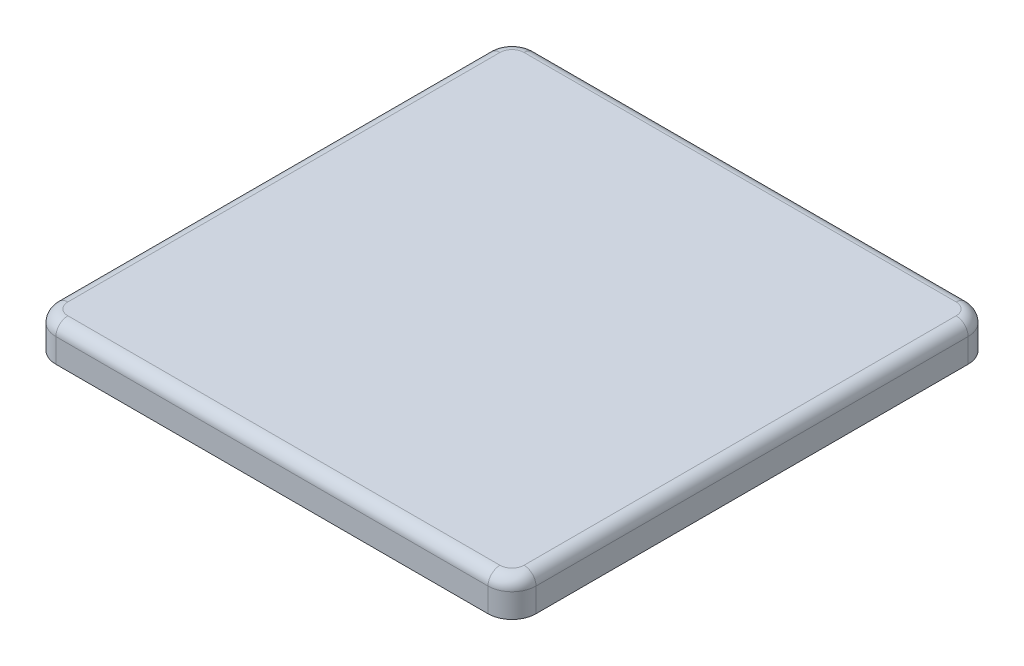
ISO-10303-21;
HEADER;
FILE_DESCRIPTION(('STEP AP214'),'2;1');
FILE_NAME('part.step','',(''),(''),'','','');
FILE_SCHEMA(('AUTOMOTIVE_DESIGN { 1 0 10303 214 1 1 1 1 }'));
ENDSEC;
DATA;
#1=APPLICATION_CONTEXT('core data for automotive mechanical design processes');
#2=APPLICATION_PROTOCOL_DEFINITION('international standard','automotive_design',2000,#1);
#3=PRODUCT_CONTEXT('',#1,'mechanical');
#4=PRODUCT('Part','Part','',(#3));
#5=PRODUCT_RELATED_PRODUCT_CATEGORY('part','',(#4));
#6=PRODUCT_DEFINITION_FORMATION('','',#4);
#7=PRODUCT_DEFINITION_CONTEXT('part definition',#1,'design');
#8=PRODUCT_DEFINITION('design','',#6,#7);
#9=PRODUCT_DEFINITION_SHAPE('','',#8);
#10=(LENGTH_UNIT() NAMED_UNIT(*) SI_UNIT(.MILLI.,.METRE.));
#11=(NAMED_UNIT(*) PLANE_ANGLE_UNIT() SI_UNIT($,.RADIAN.));
#12=(NAMED_UNIT(*) SI_UNIT($,.STERADIAN.) SOLID_ANGLE_UNIT());
#13=UNCERTAINTY_MEASURE_WITH_UNIT(LENGTH_MEASURE(1.E-05),#10,'distance_accuracy_value','');
#14=(GEOMETRIC_REPRESENTATION_CONTEXT(3) GLOBAL_UNCERTAINTY_ASSIGNED_CONTEXT((#13)) GLOBAL_UNIT_ASSIGNED_CONTEXT((#10,
#11,#12)) REPRESENTATION_CONTEXT('',''));
#15=CARTESIAN_POINT('',(0.,0.,0.));
#16=DIRECTION('',(0.,0.,1.));
#17=DIRECTION('',(1.,0.,0.));
#18=AXIS2_PLACEMENT_3D('',#15,#16,#17);
#19=CARTESIAN_POINT('',(-18.,-0.5,18.));
#20=DIRECTION('',(0.,-1.,0.));
#21=DIRECTION('',(0.,0.,-1.));
#22=AXIS2_PLACEMENT_3D('',#19,#20,#21);
#23=PLANE('',#22);
#24=DIRECTION('',(1.,0.,0.));
#25=VECTOR('',#24,1.);
#26=CARTESIAN_POINT('',(-11.35,-0.5,-12.1));
#27=LINE('',#26,#25);
#28=CARTESIAN_POINT('',(-11.35,-0.5,-12.1));
#29=VERTEX_POINT('',#28);
#30=CARTESIAN_POINT('',(-8.65,-0.5,-12.1));
#31=VERTEX_POINT('',#30);
#32=EDGE_CURVE('E356',#29,#31,#27,.T.);
#33=ORIENTED_EDGE('',*,*,#32,.F.);
#34=DIRECTION('',(0.,0.,-1.));
#35=VECTOR('',#34,1.);
#36=CARTESIAN_POINT('',(-11.35,-0.5,-7.9));
#37=LINE('',#36,#35);
#38=CARTESIAN_POINT('',(-11.35,-0.5,-7.9));
#39=VERTEX_POINT('',#38);
#40=EDGE_CURVE('E330',#39,#29,#37,.T.);
#41=ORIENTED_EDGE('',*,*,#40,.F.);
#42=DIRECTION('',(-1.,0.,0.));
#43=VECTOR('',#42,1.);
#44=CARTESIAN_POINT('',(-11.35,-0.5,-7.9));
#45=LINE('',#44,#43);
#46=CARTESIAN_POINT('',(-8.65,-0.5,-7.9));
#47=VERTEX_POINT('',#46);
#48=EDGE_CURVE('E362',#47,#39,#45,.T.);
#49=ORIENTED_EDGE('',*,*,#48,.F.);
#50=DIRECTION('',(0.,0.,1.));
#51=VECTOR('',#50,1.);
#52=CARTESIAN_POINT('',(-8.65,-0.5,-7.9));
#53=LINE('',#52,#51);
#54=EDGE_CURVE('E359',#31,#47,#53,.T.);
#55=ORIENTED_EDGE('',*,*,#54,.F.);
#56=EDGE_LOOP('',(#33,#41,#49,#55));
#57=FACE_BOUND('',#56,.T.);
#58=DIRECTION('',(1.,0.,0.));
#59=VECTOR('',#58,1.);
#60=CARTESIAN_POINT('',(-11.35,-0.5,7.9));
#61=LINE('',#60,#59);
#62=CARTESIAN_POINT('',(-11.35,-0.5,7.9));
#63=VERTEX_POINT('',#62);
#64=CARTESIAN_POINT('',(-8.65,-0.5,7.9));
#65=VERTEX_POINT('',#64);
#66=EDGE_CURVE('E396',#63,#65,#61,.T.);
#67=ORIENTED_EDGE('',*,*,#66,.F.);
#68=DIRECTION('',(0.,0.,-1.));
#69=VECTOR('',#68,1.);
#70=CARTESIAN_POINT('',(-11.35,-0.5,12.1));
#71=LINE('',#70,#69);
#72=CARTESIAN_POINT('',(-11.35,-0.5,12.1));
#73=VERTEX_POINT('',#72);
#74=EDGE_CURVE('E393',#73,#63,#71,.T.);
#75=ORIENTED_EDGE('',*,*,#74,.F.);
#76=DIRECTION('',(-1.,0.,0.));
#77=VECTOR('',#76,1.);
#78=CARTESIAN_POINT('',(-11.35,-0.5,12.1));
#79=LINE('',#78,#77);
#80=CARTESIAN_POINT('',(-8.65,-0.5,12.1));
#81=VERTEX_POINT('',#80);
#82=EDGE_CURVE('E402',#81,#73,#79,.T.);
#83=ORIENTED_EDGE('',*,*,#82,.F.);
#84=DIRECTION('',(0.,0.,1.));
#85=VECTOR('',#84,1.);
#86=CARTESIAN_POINT('',(-8.65,-0.5,12.1));
#87=LINE('',#86,#85);
#88=EDGE_CURVE('E399',#65,#81,#87,.T.);
#89=ORIENTED_EDGE('',*,*,#88,.F.);
#90=EDGE_LOOP('',(#67,#75,#83,#89));
#91=FACE_BOUND('',#90,.T.);
#92=CARTESIAN_POINT('',(-18.,-0.5,18.));
#93=DIRECTION('',(0.,-1.,0.));
#94=DIRECTION('',(0.,0.,-1.));
#95=AXIS2_PLACEMENT_3D('',#92,#93,#94);
#96=CIRCLE('',#95,0.8);
#97=CARTESIAN_POINT('',(-18.,-0.5,18.8));
#98=VERTEX_POINT('',#97);
#99=CARTESIAN_POINT('',(-18.8,-0.5,18.));
#100=VERTEX_POINT('',#99);
#101=EDGE_CURVE('E414',#98,#100,#96,.T.);
#102=ORIENTED_EDGE('',*,*,#101,.T.);
#103=DIRECTION('',(0.,0.,-1.));
#104=VECTOR('',#103,1.);
#105=CARTESIAN_POINT('',(-18.8,-0.5,18.));
#106=LINE('',#105,#104);
#107=CARTESIAN_POINT('',(-18.8,-0.5,-18.));
#108=VERTEX_POINT('',#107);
#109=EDGE_CURVE('E417',#100,#108,#106,.T.);
#110=ORIENTED_EDGE('',*,*,#109,.T.);
#111=CARTESIAN_POINT('',(-18.,-0.5,-18.));
#112=DIRECTION('',(0.,-1.,0.));
#113=DIRECTION('',(0.,0.,-1.));
#114=AXIS2_PLACEMENT_3D('',#111,#112,#113);
#115=CIRCLE('',#114,0.799999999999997);
#116=CARTESIAN_POINT('',(-18.,-0.5,-18.8));
#117=VERTEX_POINT('',#116);
#118=EDGE_CURVE('E421',#108,#117,#115,.T.);
#119=ORIENTED_EDGE('',*,*,#118,.T.);
#120=DIRECTION('',(1.,0.,0.));
#121=VECTOR('',#120,1.);
#122=CARTESIAN_POINT('',(-18.,-0.5,-18.8));
#123=LINE('',#122,#121);
#124=CARTESIAN_POINT('',(18.,-0.5,-18.8));
#125=VERTEX_POINT('',#124);
#126=EDGE_CURVE('E424',#117,#125,#123,.T.);
#127=ORIENTED_EDGE('',*,*,#126,.T.);
#128=CARTESIAN_POINT('',(18.,-0.5,-18.));
#129=DIRECTION('',(0.,-1.,0.));
#130=DIRECTION('',(0.,0.,-1.));
#131=AXIS2_PLACEMENT_3D('',#128,#129,#130);
#132=CIRCLE('',#131,0.799999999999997);
#133=CARTESIAN_POINT('',(18.8,-0.5,-18.));
#134=VERTEX_POINT('',#133);
#135=EDGE_CURVE('E427',#125,#134,#132,.T.);
#136=ORIENTED_EDGE('',*,*,#135,.T.);
#137=DIRECTION('',(0.,0.,1.));
#138=VECTOR('',#137,1.);
#139=CARTESIAN_POINT('',(18.8,-0.5,18.));
#140=LINE('',#139,#138);
#141=CARTESIAN_POINT('',(18.8,-0.5,18.));
#142=VERTEX_POINT('',#141);
#143=EDGE_CURVE('E430',#134,#142,#140,.T.);
#144=ORIENTED_EDGE('',*,*,#143,.T.);
#145=CARTESIAN_POINT('',(18.,-0.5,18.));
#146=DIRECTION('',(0.,-1.,0.));
#147=DIRECTION('',(0.,0.,-1.));
#148=AXIS2_PLACEMENT_3D('',#145,#146,#147);
#149=CIRCLE('',#148,0.8);
#150=CARTESIAN_POINT('',(18.,-0.5,18.8));
#151=VERTEX_POINT('',#150);
#152=EDGE_CURVE('E433',#142,#151,#149,.T.);
#153=ORIENTED_EDGE('',*,*,#152,.T.);
#154=DIRECTION('',(-1.,0.,0.));
#155=VECTOR('',#154,1.);
#156=CARTESIAN_POINT('',(-18.,-0.5,18.8));
#157=LINE('',#156,#155);
#158=EDGE_CURVE('E436',#151,#98,#157,.T.);
#159=ORIENTED_EDGE('',*,*,#158,.T.);
#160=EDGE_LOOP('',(#102,#110,#119,#127,#136,#144,#153,#159));
#161=FACE_BOUND('',#160,.T.);
#162=DIRECTION('',(1.,0.,0.));
#163=VECTOR('',#162,1.);
#164=CARTESIAN_POINT('',(8.65,-0.5,7.9));
#165=LINE('',#164,#163);
#166=CARTESIAN_POINT('',(8.65,-0.5,7.9));
#167=VERTEX_POINT('',#166);
#168=CARTESIAN_POINT('',(11.35,-0.5,7.9));
#169=VERTEX_POINT('',#168);
#170=EDGE_CURVE('E376',#167,#169,#165,.T.);
#171=ORIENTED_EDGE('',*,*,#170,.F.);
#172=DIRECTION('',(0.,0.,-1.));
#173=VECTOR('',#172,1.);
#174=CARTESIAN_POINT('',(8.65,-0.5,12.1));
#175=LINE('',#174,#173);
#176=CARTESIAN_POINT('',(8.65,-0.5,12.1));
#177=VERTEX_POINT('',#176);
#178=EDGE_CURVE('E373',#177,#167,#175,.T.);
#179=ORIENTED_EDGE('',*,*,#178,.F.);
#180=DIRECTION('',(-1.,0.,0.));
#181=VECTOR('',#180,1.);
#182=CARTESIAN_POINT('',(8.65,-0.5,12.1));
#183=LINE('',#182,#181);
#184=CARTESIAN_POINT('',(11.35,-0.5,12.1));
#185=VERTEX_POINT('',#184);
#186=EDGE_CURVE('E382',#185,#177,#183,.T.);
#187=ORIENTED_EDGE('',*,*,#186,.F.);
#188=DIRECTION('',(0.,0.,1.));
#189=VECTOR('',#188,1.);
#190=CARTESIAN_POINT('',(11.35,-0.5,12.1));
#191=LINE('',#190,#189);
#192=EDGE_CURVE('E379',#169,#185,#191,.T.);
#193=ORIENTED_EDGE('',*,*,#192,.F.);
#194=EDGE_LOOP('',(#171,#179,#187,#193));
#195=FACE_BOUND('',#194,.T.);
#196=DIRECTION('',(1.,0.,0.));
#197=VECTOR('',#196,1.);
#198=CARTESIAN_POINT('',(8.65,-0.5,-12.1));
#199=LINE('',#198,#197);
#200=CARTESIAN_POINT('',(8.65,-0.5,-12.1));
#201=VERTEX_POINT('',#200);
#202=CARTESIAN_POINT('',(11.35,-0.5,-12.1));
#203=VERTEX_POINT('',#202);
#204=EDGE_CURVE('E324',#201,#203,#199,.T.);
#205=ORIENTED_EDGE('',*,*,#204,.F.);
#206=DIRECTION('',(0.,0.,-1.));
#207=VECTOR('',#206,1.);
#208=CARTESIAN_POINT('',(8.65,-0.5,-7.9));
#209=LINE('',#208,#207);
#210=CARTESIAN_POINT('',(8.65,-0.5,-7.9));
#211=VERTEX_POINT('',#210);
#212=EDGE_CURVE('E334',#211,#201,#209,.T.);
#213=ORIENTED_EDGE('',*,*,#212,.F.);
#214=DIRECTION('',(-1.,0.,0.));
#215=VECTOR('',#214,1.);
#216=CARTESIAN_POINT('',(8.65,-0.5,-7.9));
#217=LINE('',#216,#215);
#218=CARTESIAN_POINT('',(11.35,-0.5,-7.9));
#219=VERTEX_POINT('',#218);
#220=EDGE_CURVE('E346',#219,#211,#217,.T.);
#221=ORIENTED_EDGE('',*,*,#220,.F.);
#222=DIRECTION('',(0.,0.,1.));
#223=VECTOR('',#222,1.);
#224=CARTESIAN_POINT('',(11.35,-0.5,-7.9));
#225=LINE('',#224,#223);
#226=EDGE_CURVE('E344',#203,#219,#225,.T.);
#227=ORIENTED_EDGE('',*,*,#226,.F.);
#228=EDGE_LOOP('',(#205,#213,#221,#227));
#229=FACE_BOUND('',#228,.T.);
#230=ADVANCED_FACE('F37',(#57,#91,#161,#195,#229),#23,.T.);
#231=CARTESIAN_POINT('',(-18.,1.5,-18.));
#232=DIRECTION('',(0.,-1.,0.));
#233=DIRECTION('',(0.,0.,-1.));
#234=AXIS2_PLACEMENT_3D('',#231,#232,#233);
#235=CYLINDRICAL_SURFACE('',#234,2.);
#236=DIRECTION('',(0.,-1.,0.));
#237=VECTOR('',#236,1.);
#238=CARTESIAN_POINT('',(-20.,1.5,-18.));
#239=LINE('',#238,#237);
#240=CARTESIAN_POINT('',(-20.,0.5,-18.));
#241=VERTEX_POINT('',#240);
#242=CARTESIAN_POINT('',(-20.,-1.5,-18.));
#243=VERTEX_POINT('',#242);
#244=EDGE_CURVE('E517',#241,#243,#239,.T.);
#245=ORIENTED_EDGE('',*,*,#244,.F.);
#246=CARTESIAN_POINT('',(-18.,0.5,-18.));
#247=DIRECTION('',(0.,1.,0.));
#248=DIRECTION('',(0.,0.,1.));
#249=AXIS2_PLACEMENT_3D('',#246,#247,#248);
#250=CIRCLE('',#249,2.);
#251=CARTESIAN_POINT('',(-18.,0.5,-20.));
#252=VERTEX_POINT('',#251);
#253=EDGE_CURVE('E541',#241,#252,#250,.F.);
#254=ORIENTED_EDGE('',*,*,#253,.T.);
#255=DIRECTION('',(0.,-1.,0.));
#256=VECTOR('',#255,1.);
#257=CARTESIAN_POINT('',(-18.,1.5,-20.));
#258=LINE('',#257,#256);
#259=CARTESIAN_POINT('',(-18.,-1.5,-20.));
#260=VERTEX_POINT('',#259);
#261=EDGE_CURVE('E503',#252,#260,#258,.T.);
#262=ORIENTED_EDGE('',*,*,#261,.T.);
#263=CARTESIAN_POINT('',(-18.,-1.5,-18.));
#264=DIRECTION('',(0.,1.,0.));
#265=DIRECTION('',(0.,0.,1.));
#266=AXIS2_PLACEMENT_3D('',#263,#264,#265);
#267=CIRCLE('',#266,2.);
#268=EDGE_CURVE('E478',#260,#243,#267,.T.);
#269=ORIENTED_EDGE('',*,*,#268,.T.);
#270=EDGE_LOOP('',(#245,#254,#262,#269));
#271=FACE_BOUND('',#270,.T.);
#272=ADVANCED_FACE('F714',(#271),#235,.T.);
#273=CARTESIAN_POINT('',(-20.,1.5,18.));
#274=DIRECTION('',(1.,0.,0.));
#275=DIRECTION('',(0.,0.,-1.));
#276=AXIS2_PLACEMENT_3D('',#273,#274,#275);
#277=PLANE('',#276);
#278=DIRECTION('',(0.,-1.,0.));
#279=VECTOR('',#278,1.);
#280=CARTESIAN_POINT('',(-20.,1.5,18.));
#281=LINE('',#280,#279);
#282=CARTESIAN_POINT('',(-20.,0.5,18.));
#283=VERTEX_POINT('',#282);
#284=CARTESIAN_POINT('',(-20.,-1.5,18.));
#285=VERTEX_POINT('',#284);
#286=EDGE_CURVE('E515',#283,#285,#281,.T.);
#287=ORIENTED_EDGE('',*,*,#286,.F.);
#288=DIRECTION('',(0.,0.,1.));
#289=VECTOR('',#288,1.);
#290=CARTESIAN_POINT('',(-20.,0.5,-18.));
#291=LINE('',#290,#289);
#292=EDGE_CURVE('E539',#283,#241,#291,.F.);
#293=ORIENTED_EDGE('',*,*,#292,.T.);
#294=ORIENTED_EDGE('',*,*,#244,.T.);
#295=DIRECTION('',(0.,0.,1.));
#296=VECTOR('',#295,1.);
#297=CARTESIAN_POINT('',(-20.,-1.5,18.));
#298=LINE('',#297,#296);
#299=EDGE_CURVE('E481',#243,#285,#298,.T.);
#300=ORIENTED_EDGE('',*,*,#299,.T.);
#301=EDGE_LOOP('',(#287,#293,#294,#300));
#302=FACE_BOUND('',#301,.T.);
#303=ADVANCED_FACE('F720',(#302),#277,.F.);
#304=CARTESIAN_POINT('',(-18.,1.5,18.));
#305=DIRECTION('',(0.,-1.,0.));
#306=DIRECTION('',(0.,0.,-1.));
#307=AXIS2_PLACEMENT_3D('',#304,#305,#306);
#308=CYLINDRICAL_SURFACE('',#307,2.);
#309=DIRECTION('',(0.,-1.,0.));
#310=VECTOR('',#309,1.);
#311=CARTESIAN_POINT('',(-18.,1.5,20.));
#312=LINE('',#311,#310);
#313=CARTESIAN_POINT('',(-18.,0.5,20.));
#314=VERTEX_POINT('',#313);
#315=CARTESIAN_POINT('',(-18.,-1.5,20.));
#316=VERTEX_POINT('',#315);
#317=EDGE_CURVE('E513',#314,#316,#312,.T.);
#318=ORIENTED_EDGE('',*,*,#317,.F.);
#319=CARTESIAN_POINT('',(-18.,0.5,18.));
#320=DIRECTION('',(0.,1.,0.));
#321=DIRECTION('',(0.,0.,1.));
#322=AXIS2_PLACEMENT_3D('',#319,#320,#321);
#323=CIRCLE('',#322,2.);
#324=EDGE_CURVE('E536',#314,#283,#323,.F.);
#325=ORIENTED_EDGE('',*,*,#324,.T.);
#326=ORIENTED_EDGE('',*,*,#286,.T.);
#327=CARTESIAN_POINT('',(-18.,-1.5,18.));
#328=DIRECTION('',(0.,1.,0.));
#329=DIRECTION('',(0.,0.,1.));
#330=AXIS2_PLACEMENT_3D('',#327,#328,#329);
#331=CIRCLE('',#330,2.);
#332=EDGE_CURVE('E485',#285,#316,#331,.T.);
#333=ORIENTED_EDGE('',*,*,#332,.T.);
#334=EDGE_LOOP('',(#318,#325,#326,#333));
#335=FACE_BOUND('',#334,.T.);
#336=ADVANCED_FACE('F789',(#335),#308,.T.);
#337=CARTESIAN_POINT('',(-18.,1.5,20.));
#338=DIRECTION('',(0.,0.,-1.));
#339=DIRECTION('',(-1.,0.,0.));
#340=AXIS2_PLACEMENT_3D('',#337,#338,#339);
#341=PLANE('',#340);
#342=DIRECTION('',(0.,-1.,0.));
#343=VECTOR('',#342,1.);
#344=CARTESIAN_POINT('',(18.,1.5,20.));
#345=LINE('',#344,#343);
#346=CARTESIAN_POINT('',(18.,0.5,20.));
#347=VERTEX_POINT('',#346);
#348=CARTESIAN_POINT('',(18.,-1.5,20.));
#349=VERTEX_POINT('',#348);
#350=EDGE_CURVE('E511',#347,#349,#345,.T.);
#351=ORIENTED_EDGE('',*,*,#350,.F.);
#352=DIRECTION('',(1.,0.,0.));
#353=VECTOR('',#352,1.);
#354=CARTESIAN_POINT('',(-18.,0.5,20.));
#355=LINE('',#354,#353);
#356=EDGE_CURVE('E551',#347,#314,#355,.F.);
#357=ORIENTED_EDGE('',*,*,#356,.T.);
#358=ORIENTED_EDGE('',*,*,#317,.T.);
#359=DIRECTION('',(1.,0.,0.));
#360=VECTOR('',#359,1.);
#361=CARTESIAN_POINT('',(-18.,-1.5,20.));
#362=LINE('',#361,#360);
#363=EDGE_CURVE('E488',#316,#349,#362,.T.);
#364=ORIENTED_EDGE('',*,*,#363,.T.);
#365=EDGE_LOOP('',(#351,#357,#358,#364));
#366=FACE_BOUND('',#365,.T.);
#367=ADVANCED_FACE('F785',(#366),#341,.F.);
#368=CARTESIAN_POINT('',(18.,1.5,18.));
#369=DIRECTION('',(0.,-1.,0.));
#370=DIRECTION('',(0.,0.,-1.));
#371=AXIS2_PLACEMENT_3D('',#368,#369,#370);
#372=CYLINDRICAL_SURFACE('',#371,2.);
#373=DIRECTION('',(0.,-1.,0.));
#374=VECTOR('',#373,1.);
#375=CARTESIAN_POINT('',(20.,1.5,18.));
#376=LINE('',#375,#374);
#377=CARTESIAN_POINT('',(20.,0.5,18.));
#378=VERTEX_POINT('',#377);
#379=CARTESIAN_POINT('',(20.,-1.5,18.));
#380=VERTEX_POINT('',#379);
#381=EDGE_CURVE('E509',#378,#380,#376,.T.);
#382=ORIENTED_EDGE('',*,*,#381,.F.);
#383=CARTESIAN_POINT('',(18.,0.5,18.));
#384=DIRECTION('',(0.,1.,0.));
#385=DIRECTION('',(0.,0.,1.));
#386=AXIS2_PLACEMENT_3D('',#383,#384,#385);
#387=CIRCLE('',#386,2.);
#388=EDGE_CURVE('E549',#378,#347,#387,.F.);
#389=ORIENTED_EDGE('',*,*,#388,.T.);
#390=ORIENTED_EDGE('',*,*,#350,.T.);
#391=CARTESIAN_POINT('',(18.,-1.5,18.));
#392=DIRECTION('',(0.,1.,0.));
#393=DIRECTION('',(0.,0.,1.));
#394=AXIS2_PLACEMENT_3D('',#391,#392,#393);
#395=CIRCLE('',#394,2.);
#396=EDGE_CURVE('E491',#349,#380,#395,.T.);
#397=ORIENTED_EDGE('',*,*,#396,.T.);
#398=EDGE_LOOP('',(#382,#389,#390,#397));
#399=FACE_BOUND('',#398,.T.);
#400=ADVANCED_FACE('F781',(#399),#372,.T.);
#401=CARTESIAN_POINT('',(20.,1.5,18.));
#402=DIRECTION('',(-1.,0.,0.));
#403=DIRECTION('',(0.,0.,1.));
#404=AXIS2_PLACEMENT_3D('',#401,#402,#403);
#405=PLANE('',#404);
#406=DIRECTION('',(0.,-1.,0.));
#407=VECTOR('',#406,1.);
#408=CARTESIAN_POINT('',(20.,1.5,-18.));
#409=LINE('',#408,#407);
#410=CARTESIAN_POINT('',(20.,0.5,-18.));
#411=VERTEX_POINT('',#410);
#412=CARTESIAN_POINT('',(20.,-1.5,-18.));
#413=VERTEX_POINT('',#412);
#414=EDGE_CURVE('E507',#411,#413,#409,.T.);
#415=ORIENTED_EDGE('',*,*,#414,.F.);
#416=DIRECTION('',(0.,0.,-1.));
#417=VECTOR('',#416,1.);
#418=CARTESIAN_POINT('',(20.,0.5,18.));
#419=LINE('',#418,#417);
#420=EDGE_CURVE('E547',#411,#378,#419,.F.);
#421=ORIENTED_EDGE('',*,*,#420,.T.);
#422=ORIENTED_EDGE('',*,*,#381,.T.);
#423=DIRECTION('',(0.,0.,-1.));
#424=VECTOR('',#423,1.);
#425=CARTESIAN_POINT('',(20.,-1.5,18.));
#426=LINE('',#425,#424);
#427=EDGE_CURVE('E494',#380,#413,#426,.T.);
#428=ORIENTED_EDGE('',*,*,#427,.T.);
#429=EDGE_LOOP('',(#415,#421,#422,#428));
#430=FACE_BOUND('',#429,.T.);
#431=ADVANCED_FACE('F777',(#430),#405,.F.);
#432=CARTESIAN_POINT('',(18.,1.5,-18.));
#433=DIRECTION('',(0.,-1.,0.));
#434=DIRECTION('',(0.,0.,-1.));
#435=AXIS2_PLACEMENT_3D('',#432,#433,#434);
#436=CYLINDRICAL_SURFACE('',#435,2.);
#437=DIRECTION('',(0.,-1.,0.));
#438=VECTOR('',#437,1.);
#439=CARTESIAN_POINT('',(18.,1.5,-20.));
#440=LINE('',#439,#438);
#441=CARTESIAN_POINT('',(18.,0.5,-20.));
#442=VERTEX_POINT('',#441);
#443=CARTESIAN_POINT('',(18.,-1.5,-20.));
#444=VERTEX_POINT('',#443);
#445=EDGE_CURVE('E505',#442,#444,#440,.T.);
#446=ORIENTED_EDGE('',*,*,#445,.F.);
#447=CARTESIAN_POINT('',(18.,0.5,-18.));
#448=DIRECTION('',(0.,1.,0.));
#449=DIRECTION('',(0.,0.,1.));
#450=AXIS2_PLACEMENT_3D('',#447,#448,#449);
#451=CIRCLE('',#450,2.);
#452=EDGE_CURVE('E545',#442,#411,#451,.F.);
#453=ORIENTED_EDGE('',*,*,#452,.T.);
#454=ORIENTED_EDGE('',*,*,#414,.T.);
#455=CARTESIAN_POINT('',(18.,-1.5,-18.));
#456=DIRECTION('',(0.,1.,0.));
#457=DIRECTION('',(0.,0.,1.));
#458=AXIS2_PLACEMENT_3D('',#455,#456,#457);
#459=CIRCLE('',#458,2.);
#460=EDGE_CURVE('E497',#413,#444,#459,.T.);
#461=ORIENTED_EDGE('',*,*,#460,.T.);
#462=EDGE_LOOP('',(#446,#453,#454,#461));
#463=FACE_BOUND('',#462,.T.);
#464=ADVANCED_FACE('F773',(#463),#436,.T.);
#465=CARTESIAN_POINT('',(-18.,1.5,-20.));
#466=DIRECTION('',(0.,0.,1.));
#467=DIRECTION('',(1.,0.,0.));
#468=AXIS2_PLACEMENT_3D('',#465,#466,#467);
#469=PLANE('',#468);
#470=ORIENTED_EDGE('',*,*,#261,.F.);
#471=DIRECTION('',(-1.,0.,0.));
#472=VECTOR('',#471,1.);
#473=CARTESIAN_POINT('',(18.,0.5,-20.));
#474=LINE('',#473,#472);
#475=EDGE_CURVE('E543',#252,#442,#474,.F.);
#476=ORIENTED_EDGE('',*,*,#475,.T.);
#477=ORIENTED_EDGE('',*,*,#445,.T.);
#478=DIRECTION('',(-1.,0.,0.));
#479=VECTOR('',#478,1.);
#480=CARTESIAN_POINT('',(-18.,-1.5,-20.));
#481=LINE('',#480,#479);
#482=EDGE_CURVE('E500',#444,#260,#481,.T.);
#483=ORIENTED_EDGE('',*,*,#482,.T.);
#484=EDGE_LOOP('',(#470,#476,#477,#483));
#485=FACE_BOUND('',#484,.T.);
#486=ADVANCED_FACE('F765',(#485),#469,.F.);
#487=CARTESIAN_POINT('',(-18.,1.5,-18.));
#488=DIRECTION('',(0.,1.,0.));
#489=DIRECTION('',(0.,0.,1.));
#490=AXIS2_PLACEMENT_3D('',#487,#488,#489);
#491=PLANE('',#490);
#492=DIRECTION('',(0.,0.,1.));
#493=VECTOR('',#492,1.);
#494=CARTESIAN_POINT('',(-19.,1.5,18.));
#495=LINE('',#494,#493);
#496=CARTESIAN_POINT('',(-19.,1.5,-18.));
#497=VERTEX_POINT('',#496);
#498=CARTESIAN_POINT('',(-19.,1.5,18.));
#499=VERTEX_POINT('',#498);
#500=EDGE_CURVE('E531',#497,#499,#495,.T.);
#501=ORIENTED_EDGE('',*,*,#500,.T.);
#502=CARTESIAN_POINT('',(-18.,1.5,18.));
#503=DIRECTION('',(0.,1.,0.));
#504=DIRECTION('',(0.,0.,1.));
#505=AXIS2_PLACEMENT_3D('',#502,#503,#504);
#506=CIRCLE('',#505,1.);
#507=CARTESIAN_POINT('',(-18.,1.5,19.));
#508=VERTEX_POINT('',#507);
#509=EDGE_CURVE('E533',#499,#508,#506,.T.);
#510=ORIENTED_EDGE('',*,*,#509,.T.);
#511=DIRECTION('',(1.,0.,0.));
#512=VECTOR('',#511,1.);
#513=CARTESIAN_POINT('',(18.,1.5,19.));
#514=LINE('',#513,#512);
#515=CARTESIAN_POINT('',(18.,1.5,19.));
#516=VERTEX_POINT('',#515);
#517=EDGE_CURVE('E519',#508,#516,#514,.T.);
#518=ORIENTED_EDGE('',*,*,#517,.T.);
#519=CARTESIAN_POINT('',(18.,1.5,18.));
#520=DIRECTION('',(0.,1.,0.));
#521=DIRECTION('',(0.,0.,1.));
#522=AXIS2_PLACEMENT_3D('',#519,#520,#521);
#523=CIRCLE('',#522,1.);
#524=CARTESIAN_POINT('',(19.,1.5,18.));
#525=VERTEX_POINT('',#524);
#526=EDGE_CURVE('E521',#516,#525,#523,.T.);
#527=ORIENTED_EDGE('',*,*,#526,.T.);
#528=DIRECTION('',(0.,0.,-1.));
#529=VECTOR('',#528,1.);
#530=CARTESIAN_POINT('',(19.,1.5,-18.));
#531=LINE('',#530,#529);
#532=CARTESIAN_POINT('',(19.,1.5,-18.));
#533=VERTEX_POINT('',#532);
#534=EDGE_CURVE('E523',#525,#533,#531,.T.);
#535=ORIENTED_EDGE('',*,*,#534,.T.);
#536=CARTESIAN_POINT('',(18.,1.5,-18.));
#537=DIRECTION('',(0.,1.,0.));
#538=DIRECTION('',(0.,0.,1.));
#539=AXIS2_PLACEMENT_3D('',#536,#537,#538);
#540=CIRCLE('',#539,1.);
#541=CARTESIAN_POINT('',(18.,1.5,-19.));
#542=VERTEX_POINT('',#541);
#543=EDGE_CURVE('E525',#533,#542,#540,.T.);
#544=ORIENTED_EDGE('',*,*,#543,.T.);
#545=DIRECTION('',(-1.,0.,0.));
#546=VECTOR('',#545,1.);
#547=CARTESIAN_POINT('',(-18.,1.5,-19.));
#548=LINE('',#547,#546);
#549=CARTESIAN_POINT('',(-18.,1.5,-19.));
#550=VERTEX_POINT('',#549);
#551=EDGE_CURVE('E527',#542,#550,#548,.T.);
#552=ORIENTED_EDGE('',*,*,#551,.T.);
#553=CARTESIAN_POINT('',(-18.,1.5,-18.));
#554=DIRECTION('',(0.,1.,0.));
#555=DIRECTION('',(0.,0.,1.));
#556=AXIS2_PLACEMENT_3D('',#553,#554,#555);
#557=CIRCLE('',#556,0.999999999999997);
#558=EDGE_CURVE('E529',#550,#497,#557,.T.);
#559=ORIENTED_EDGE('',*,*,#558,.T.);
#560=EDGE_LOOP('',(#501,#510,#518,#527,#535,#544,#552,#559));
#561=FACE_BOUND('',#560,.T.);
#562=ADVANCED_FACE('F761',(#561),#491,.T.);
#563=CARTESIAN_POINT('',(-18.,-1.5,-18.));
#564=DIRECTION('',(0.,1.,0.));
#565=DIRECTION('',(0.,0.,1.));
#566=AXIS2_PLACEMENT_3D('',#563,#564,#565);
#567=PLANE('',#566);
#568=DIRECTION('',(0.,0.,-1.));
#569=VECTOR('',#568,1.);
#570=CARTESIAN_POINT('',(-18.8,-1.5,18.));
#571=LINE('',#570,#569);
#572=CARTESIAN_POINT('',(-18.8,-1.5,18.));
#573=VERTEX_POINT('',#572);
#574=CARTESIAN_POINT('',(-18.8,-1.5,-18.));
#575=VERTEX_POINT('',#574);
#576=EDGE_CURVE('E441',#573,#575,#571,.T.);
#577=ORIENTED_EDGE('',*,*,#576,.F.);
#578=CARTESIAN_POINT('',(-18.,-1.5,18.));
#579=DIRECTION('',(0.,-1.,0.));
#580=DIRECTION('',(0.,0.,-1.));
#581=AXIS2_PLACEMENT_3D('',#578,#579,#580);
#582=CIRCLE('',#581,0.8);
#583=CARTESIAN_POINT('',(-18.,-1.5,18.8));
#584=VERTEX_POINT('',#583);
#585=EDGE_CURVE('E413',#584,#573,#582,.T.);
#586=ORIENTED_EDGE('',*,*,#585,.F.);
#587=DIRECTION('',(-1.,0.,0.));
#588=VECTOR('',#587,1.);
#589=CARTESIAN_POINT('',(-18.,-1.5,18.8));
#590=LINE('',#589,#588);
#591=CARTESIAN_POINT('',(18.,-1.5,18.8));
#592=VERTEX_POINT('',#591);
#593=EDGE_CURVE('E418',#592,#584,#590,.T.);
#594=ORIENTED_EDGE('',*,*,#593,.F.);
#595=CARTESIAN_POINT('',(18.,-1.5,18.));
#596=DIRECTION('',(0.,-1.,0.));
#597=DIRECTION('',(0.,0.,-1.));
#598=AXIS2_PLACEMENT_3D('',#595,#596,#597);
#599=CIRCLE('',#598,0.8);
#600=CARTESIAN_POINT('',(18.8,-1.5,18.));
#601=VERTEX_POINT('',#600);
#602=EDGE_CURVE('E456',#601,#592,#599,.T.);
#603=ORIENTED_EDGE('',*,*,#602,.F.);
#604=DIRECTION('',(0.,0.,1.));
#605=VECTOR('',#604,1.);
#606=CARTESIAN_POINT('',(18.8,-1.5,18.));
#607=LINE('',#606,#605);
#608=CARTESIAN_POINT('',(18.8,-1.5,-18.));
#609=VERTEX_POINT('',#608);
#610=EDGE_CURVE('E453',#609,#601,#607,.T.);
#611=ORIENTED_EDGE('',*,*,#610,.F.);
#612=CARTESIAN_POINT('',(18.,-1.5,-18.));
#613=DIRECTION('',(0.,-1.,0.));
#614=DIRECTION('',(0.,0.,-1.));
#615=AXIS2_PLACEMENT_3D('',#612,#613,#614);
#616=CIRCLE('',#615,0.799999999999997);
#617=CARTESIAN_POINT('',(18.,-1.5,-18.8));
#618=VERTEX_POINT('',#617);
#619=EDGE_CURVE('E450',#618,#609,#616,.T.);
#620=ORIENTED_EDGE('',*,*,#619,.F.);
#621=DIRECTION('',(1.,0.,0.));
#622=VECTOR('',#621,1.);
#623=CARTESIAN_POINT('',(-18.,-1.5,-18.8));
#624=LINE('',#623,#622);
#625=CARTESIAN_POINT('',(-18.,-1.5,-18.8));
#626=VERTEX_POINT('',#625);
#627=EDGE_CURVE('E447',#626,#618,#624,.T.);
#628=ORIENTED_EDGE('',*,*,#627,.F.);
#629=CARTESIAN_POINT('',(-18.,-1.5,-18.));
#630=DIRECTION('',(0.,-1.,0.));
#631=DIRECTION('',(0.,0.,-1.));
#632=AXIS2_PLACEMENT_3D('',#629,#630,#631);
#633=CIRCLE('',#632,0.799999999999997);
#634=EDGE_CURVE('E444',#575,#626,#633,.T.);
#635=ORIENTED_EDGE('',*,*,#634,.F.);
#636=EDGE_LOOP('',(#577,#586,#594,#603,#611,#620,#628,#635));
#637=FACE_BOUND('',#636,.T.);
#638=ORIENTED_EDGE('',*,*,#268,.F.);
#639=ORIENTED_EDGE('',*,*,#482,.F.);
#640=ORIENTED_EDGE('',*,*,#460,.F.);
#641=ORIENTED_EDGE('',*,*,#427,.F.);
#642=ORIENTED_EDGE('',*,*,#396,.F.);
#643=ORIENTED_EDGE('',*,*,#363,.F.);
#644=ORIENTED_EDGE('',*,*,#332,.F.);
#645=ORIENTED_EDGE('',*,*,#299,.F.);
#646=EDGE_LOOP('',(#638,#639,#640,#641,#642,#643,#644,#645));
#647=FACE_BOUND('',#646,.T.);
#648=ADVANCED_FACE('F764',(#637,#647),#567,.F.);
#649=CARTESIAN_POINT('',(18.,0.5,-18.));
#650=DIRECTION('',(0.,1.,0.));
#651=DIRECTION('',(0.,0.,1.));
#652=AXIS2_PLACEMENT_3D('',#649,#650,#651);
#653=DEGENERATE_TOROIDAL_SURFACE('',#652,1.,1.,.T.);
#654=CARTESIAN_POINT('',(19.,0.5,-18.));
#655=DIRECTION('',(0.,0.,1.));
#656=DIRECTION('',(1.,0.,0.));
#657=AXIS2_PLACEMENT_3D('',#654,#655,#656);
#658=CIRCLE('',#657,1.);
#659=EDGE_CURVE('E569',#411,#533,#658,.T.);
#660=ORIENTED_EDGE('',*,*,#659,.F.);
#661=ORIENTED_EDGE('',*,*,#452,.F.);
#662=CARTESIAN_POINT('',(18.,0.5,-19.));
#663=DIRECTION('',(-1.,0.,0.));
#664=DIRECTION('',(0.,0.,1.));
#665=AXIS2_PLACEMENT_3D('',#662,#663,#664);
#666=CIRCLE('',#665,1.);
#667=EDGE_CURVE('E482',#542,#442,#666,.T.);
#668=ORIENTED_EDGE('',*,*,#667,.F.);
#669=ORIENTED_EDGE('',*,*,#543,.F.);
#670=EDGE_LOOP('',(#660,#661,#668,#669));
#671=FACE_BOUND('',#670,.T.);
#672=ADVANCED_FACE('F769',(#671),#653,.T.);
#673=CARTESIAN_POINT('',(-18.,0.5,-19.));
#674=DIRECTION('',(1.,0.,0.));
#675=DIRECTION('',(0.,0.,-1.));
#676=AXIS2_PLACEMENT_3D('',#673,#674,#675);
#677=CYLINDRICAL_SURFACE('',#676,1.);
#678=ORIENTED_EDGE('',*,*,#667,.T.);
#679=ORIENTED_EDGE('',*,*,#475,.F.);
#680=CARTESIAN_POINT('',(-18.,0.5,-19.));
#681=DIRECTION('',(-1.,0.,0.));
#682=DIRECTION('',(0.,0.,1.));
#683=AXIS2_PLACEMENT_3D('',#680,#681,#682);
#684=CIRCLE('',#683,1.);
#685=EDGE_CURVE('E566',#550,#252,#684,.T.);
#686=ORIENTED_EDGE('',*,*,#685,.F.);
#687=ORIENTED_EDGE('',*,*,#551,.F.);
#688=EDGE_LOOP('',(#678,#679,#686,#687));
#689=FACE_BOUND('',#688,.T.);
#690=ADVANCED_FACE('F819',(#689),#677,.T.);
#691=CARTESIAN_POINT('',(19.,0.5,-18.));
#692=DIRECTION('',(0.,0.,1.));
#693=DIRECTION('',(1.,0.,0.));
#694=AXIS2_PLACEMENT_3D('',#691,#692,#693);
#695=CYLINDRICAL_SURFACE('',#694,1.);
#696=ORIENTED_EDGE('',*,*,#659,.T.);
#697=ORIENTED_EDGE('',*,*,#534,.F.);
#698=CARTESIAN_POINT('',(19.,0.5,18.));
#699=DIRECTION('',(0.,0.,1.));
#700=DIRECTION('',(1.,0.,0.));
#701=AXIS2_PLACEMENT_3D('',#698,#699,#700);
#702=CIRCLE('',#701,1.);
#703=EDGE_CURVE('E563',#378,#525,#702,.T.);
#704=ORIENTED_EDGE('',*,*,#703,.F.);
#705=ORIENTED_EDGE('',*,*,#420,.F.);
#706=EDGE_LOOP('',(#696,#697,#704,#705));
#707=FACE_BOUND('',#706,.T.);
#708=ADVANCED_FACE('F815',(#707),#695,.T.);
#709=CARTESIAN_POINT('',(-18.,0.5,-18.));
#710=DIRECTION('',(0.,1.,0.));
#711=DIRECTION('',(0.,0.,1.));
#712=AXIS2_PLACEMENT_3D('',#709,#710,#711);
#713=DEGENERATE_TOROIDAL_SURFACE('',#712,0.999999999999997,1.,.T.);
#714=ORIENTED_EDGE('',*,*,#685,.T.);
#715=ORIENTED_EDGE('',*,*,#253,.F.);
#716=CARTESIAN_POINT('',(-19.,0.5,-18.));
#717=DIRECTION('',(0.,0.,1.));
#718=DIRECTION('',(1.,0.,0.));
#719=AXIS2_PLACEMENT_3D('',#716,#717,#718);
#720=CIRCLE('',#719,1.);
#721=EDGE_CURVE('E560',#497,#241,#720,.T.);
#722=ORIENTED_EDGE('',*,*,#721,.F.);
#723=ORIENTED_EDGE('',*,*,#558,.F.);
#724=EDGE_LOOP('',(#714,#715,#722,#723));
#725=FACE_BOUND('',#724,.T.);
#726=ADVANCED_FACE('F811',(#725),#713,.T.);
#727=CARTESIAN_POINT('',(18.,0.5,18.));
#728=DIRECTION('',(0.,1.,0.));
#729=DIRECTION('',(0.,0.,1.));
#730=AXIS2_PLACEMENT_3D('',#727,#728,#729);
#731=DEGENERATE_TOROIDAL_SURFACE('',#730,1.,1.,.T.);
#732=ORIENTED_EDGE('',*,*,#703,.T.);
#733=ORIENTED_EDGE('',*,*,#526,.F.);
#734=CARTESIAN_POINT('',(18.,0.5,19.));
#735=DIRECTION('',(-1.,0.,0.));
#736=DIRECTION('',(0.,0.,1.));
#737=AXIS2_PLACEMENT_3D('',#734,#735,#736);
#738=CIRCLE('',#737,1.);
#739=EDGE_CURVE('E557',#347,#516,#738,.T.);
#740=ORIENTED_EDGE('',*,*,#739,.F.);
#741=ORIENTED_EDGE('',*,*,#388,.F.);
#742=EDGE_LOOP('',(#732,#733,#740,#741));
#743=FACE_BOUND('',#742,.T.);
#744=ADVANCED_FACE('F807',(#743),#731,.T.);
#745=CARTESIAN_POINT('',(-19.,0.5,-18.));
#746=DIRECTION('',(0.,0.,-1.));
#747=DIRECTION('',(-1.,0.,0.));
#748=AXIS2_PLACEMENT_3D('',#745,#746,#747);
#749=CYLINDRICAL_SURFACE('',#748,1.);
#750=ORIENTED_EDGE('',*,*,#721,.T.);
#751=ORIENTED_EDGE('',*,*,#292,.F.);
#752=CARTESIAN_POINT('',(-19.,0.5,18.));
#753=DIRECTION('',(0.,0.,1.));
#754=DIRECTION('',(1.,0.,0.));
#755=AXIS2_PLACEMENT_3D('',#752,#753,#754);
#756=CIRCLE('',#755,1.);
#757=EDGE_CURVE('E555',#499,#283,#756,.T.);
#758=ORIENTED_EDGE('',*,*,#757,.F.);
#759=ORIENTED_EDGE('',*,*,#500,.F.);
#760=EDGE_LOOP('',(#750,#751,#758,#759));
#761=FACE_BOUND('',#760,.T.);
#762=ADVANCED_FACE('F803',(#761),#749,.T.);
#763=CARTESIAN_POINT('',(-18.,0.5,19.));
#764=DIRECTION('',(-1.,0.,0.));
#765=DIRECTION('',(0.,0.,1.));
#766=AXIS2_PLACEMENT_3D('',#763,#764,#765);
#767=CYLINDRICAL_SURFACE('',#766,1.);
#768=ORIENTED_EDGE('',*,*,#739,.T.);
#769=ORIENTED_EDGE('',*,*,#517,.F.);
#770=CARTESIAN_POINT('',(-18.,0.5,19.));
#771=DIRECTION('',(-1.,0.,0.));
#772=DIRECTION('',(0.,0.,1.));
#773=AXIS2_PLACEMENT_3D('',#770,#771,#772);
#774=CIRCLE('',#773,1.);
#775=EDGE_CURVE('E463',#314,#508,#774,.T.);
#776=ORIENTED_EDGE('',*,*,#775,.F.);
#777=ORIENTED_EDGE('',*,*,#356,.F.);
#778=EDGE_LOOP('',(#768,#769,#776,#777));
#779=FACE_BOUND('',#778,.T.);
#780=ADVANCED_FACE('F799',(#779),#767,.T.);
#781=CARTESIAN_POINT('',(-18.,0.5,18.));
#782=DIRECTION('',(0.,1.,0.));
#783=DIRECTION('',(0.,0.,1.));
#784=AXIS2_PLACEMENT_3D('',#781,#782,#783);
#785=DEGENERATE_TOROIDAL_SURFACE('',#784,1.,1.,.T.);
#786=ORIENTED_EDGE('',*,*,#757,.T.);
#787=ORIENTED_EDGE('',*,*,#324,.F.);
#788=ORIENTED_EDGE('',*,*,#775,.T.);
#789=ORIENTED_EDGE('',*,*,#509,.F.);
#790=EDGE_LOOP('',(#786,#787,#788,#789));
#791=FACE_BOUND('',#790,.T.);
#792=ADVANCED_FACE('F759',(#791),#785,.T.);
#793=CARTESIAN_POINT('',(-18.,-0.5,18.));
#794=DIRECTION('',(0.,-1.,0.));
#795=DIRECTION('',(0.,0.,-1.));
#796=AXIS2_PLACEMENT_3D('',#793,#794,#795);
#797=CYLINDRICAL_SURFACE('',#796,0.8);
#798=ORIENTED_EDGE('',*,*,#585,.T.);
#799=DIRECTION('',(0.,-1.,0.));
#800=VECTOR('',#799,1.);
#801=CARTESIAN_POINT('',(-18.8,-0.5,18.));
#802=LINE('',#801,#800);
#803=EDGE_CURVE('E439',#100,#573,#802,.T.);
#804=ORIENTED_EDGE('',*,*,#803,.F.);
#805=ORIENTED_EDGE('',*,*,#101,.F.);
#806=DIRECTION('',(0.,-1.,0.));
#807=VECTOR('',#806,1.);
#808=CARTESIAN_POINT('',(-18.,-0.5,18.8));
#809=LINE('',#808,#807);
#810=EDGE_CURVE('E461',#98,#584,#809,.T.);
#811=ORIENTED_EDGE('',*,*,#810,.T.);
#812=EDGE_LOOP('',(#798,#804,#805,#811));
#813=FACE_BOUND('',#812,.T.);
#814=ADVANCED_FACE('F732',(#813),#797,.F.);
#815=CARTESIAN_POINT('',(-18.,-0.5,18.8));
#816=DIRECTION('',(0.,0.,1.));
#817=DIRECTION('',(1.,0.,0.));
#818=AXIS2_PLACEMENT_3D('',#815,#816,#817);
#819=PLANE('',#818);
#820=ORIENTED_EDGE('',*,*,#593,.T.);
#821=ORIENTED_EDGE('',*,*,#810,.F.);
#822=ORIENTED_EDGE('',*,*,#158,.F.);
#823=DIRECTION('',(0.,-1.,0.));
#824=VECTOR('',#823,1.);
#825=CARTESIAN_POINT('',(18.,-0.5,18.8));
#826=LINE('',#825,#824);
#827=EDGE_CURVE('E464',#151,#592,#826,.T.);
#828=ORIENTED_EDGE('',*,*,#827,.T.);
#829=EDGE_LOOP('',(#820,#821,#822,#828));
#830=FACE_BOUND('',#829,.T.);
#831=ADVANCED_FACE('F728',(#830),#819,.F.);
#832=CARTESIAN_POINT('',(18.,-0.5,18.));
#833=DIRECTION('',(0.,-1.,0.));
#834=DIRECTION('',(0.,0.,-1.));
#835=AXIS2_PLACEMENT_3D('',#832,#833,#834);
#836=CYLINDRICAL_SURFACE('',#835,0.8);
#837=ORIENTED_EDGE('',*,*,#602,.T.);
#838=ORIENTED_EDGE('',*,*,#827,.F.);
#839=ORIENTED_EDGE('',*,*,#152,.F.);
#840=DIRECTION('',(0.,-1.,0.));
#841=VECTOR('',#840,1.);
#842=CARTESIAN_POINT('',(18.8,-0.5,18.));
#843=LINE('',#842,#841);
#844=EDGE_CURVE('E466',#142,#601,#843,.T.);
#845=ORIENTED_EDGE('',*,*,#844,.T.);
#846=EDGE_LOOP('',(#837,#838,#839,#845));
#847=FACE_BOUND('',#846,.T.);
#848=ADVANCED_FACE('F731',(#847),#836,.F.);
#849=CARTESIAN_POINT('',(18.8,-0.5,18.));
#850=DIRECTION('',(1.,0.,0.));
#851=DIRECTION('',(0.,0.,-1.));
#852=AXIS2_PLACEMENT_3D('',#849,#850,#851);
#853=PLANE('',#852);
#854=ORIENTED_EDGE('',*,*,#610,.T.);
#855=ORIENTED_EDGE('',*,*,#844,.F.);
#856=ORIENTED_EDGE('',*,*,#143,.F.);
#857=DIRECTION('',(0.,-1.,0.));
#858=VECTOR('',#857,1.);
#859=CARTESIAN_POINT('',(18.8,-0.5,-18.));
#860=LINE('',#859,#858);
#861=EDGE_CURVE('E468',#134,#609,#860,.T.);
#862=ORIENTED_EDGE('',*,*,#861,.T.);
#863=EDGE_LOOP('',(#854,#855,#856,#862));
#864=FACE_BOUND('',#863,.T.);
#865=ADVANCED_FACE('F736',(#864),#853,.F.);
#866=CARTESIAN_POINT('',(18.,-0.5,-18.));
#867=DIRECTION('',(0.,-1.,0.));
#868=DIRECTION('',(0.,0.,-1.));
#869=AXIS2_PLACEMENT_3D('',#866,#867,#868);
#870=CYLINDRICAL_SURFACE('',#869,0.799999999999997);
#871=ORIENTED_EDGE('',*,*,#619,.T.);
#872=ORIENTED_EDGE('',*,*,#861,.F.);
#873=ORIENTED_EDGE('',*,*,#135,.F.);
#874=DIRECTION('',(0.,-1.,0.));
#875=VECTOR('',#874,1.);
#876=CARTESIAN_POINT('',(18.,-0.5,-18.8));
#877=LINE('',#876,#875);
#878=EDGE_CURVE('E470',#125,#618,#877,.T.);
#879=ORIENTED_EDGE('',*,*,#878,.T.);
#880=EDGE_LOOP('',(#871,#872,#873,#879));
#881=FACE_BOUND('',#880,.T.);
#882=ADVANCED_FACE('F740',(#881),#870,.F.);
#883=CARTESIAN_POINT('',(-18.,-0.5,-18.8));
#884=DIRECTION('',(0.,0.,-1.));
#885=DIRECTION('',(-1.,0.,0.));
#886=AXIS2_PLACEMENT_3D('',#883,#884,#885);
#887=PLANE('',#886);
#888=ORIENTED_EDGE('',*,*,#627,.T.);
#889=ORIENTED_EDGE('',*,*,#878,.F.);
#890=ORIENTED_EDGE('',*,*,#126,.F.);
#891=DIRECTION('',(0.,-1.,0.));
#892=VECTOR('',#891,1.);
#893=CARTESIAN_POINT('',(-18.,-0.5,-18.8));
#894=LINE('',#893,#892);
#895=EDGE_CURVE('E472',#117,#626,#894,.T.);
#896=ORIENTED_EDGE('',*,*,#895,.T.);
#897=EDGE_LOOP('',(#888,#889,#890,#896));
#898=FACE_BOUND('',#897,.T.);
#899=ADVANCED_FACE('F744',(#898),#887,.F.);
#900=CARTESIAN_POINT('',(-18.,-0.5,-18.));
#901=DIRECTION('',(0.,-1.,0.));
#902=DIRECTION('',(0.,0.,-1.));
#903=AXIS2_PLACEMENT_3D('',#900,#901,#902);
#904=CYLINDRICAL_SURFACE('',#903,0.799999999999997);
#905=ORIENTED_EDGE('',*,*,#634,.T.);
#906=ORIENTED_EDGE('',*,*,#895,.F.);
#907=ORIENTED_EDGE('',*,*,#118,.F.);
#908=DIRECTION('',(0.,-1.,0.));
#909=VECTOR('',#908,1.);
#910=CARTESIAN_POINT('',(-18.8,-0.5,-18.));
#911=LINE('',#910,#909);
#912=EDGE_CURVE('E474',#108,#575,#911,.T.);
#913=ORIENTED_EDGE('',*,*,#912,.T.);
#914=EDGE_LOOP('',(#905,#906,#907,#913));
#915=FACE_BOUND('',#914,.T.);
#916=ADVANCED_FACE('F748',(#915),#904,.F.);
#917=CARTESIAN_POINT('',(-18.8,-0.5,18.));
#918=DIRECTION('',(-1.,0.,0.));
#919=DIRECTION('',(0.,0.,1.));
#920=AXIS2_PLACEMENT_3D('',#917,#918,#919);
#921=PLANE('',#920);
#922=ORIENTED_EDGE('',*,*,#576,.T.);
#923=ORIENTED_EDGE('',*,*,#912,.F.);
#924=ORIENTED_EDGE('',*,*,#109,.F.);
#925=ORIENTED_EDGE('',*,*,#803,.T.);
#926=EDGE_LOOP('',(#922,#923,#924,#925));
#927=FACE_BOUND('',#926,.T.);
#928=ADVANCED_FACE('F752',(#927),#921,.F.);
#929=CARTESIAN_POINT('',(-11.35,-7.5,12.1));
#930=DIRECTION('',(1.,0.,0.));
#931=DIRECTION('',(0.,0.,-1.));
#932=AXIS2_PLACEMENT_3D('',#929,#930,#931);
#933=PLANE('',#932);
#934=DIRECTION('',(0.,1.,0.));
#935=VECTOR('',#934,1.);
#936=CARTESIAN_POINT('',(-11.35,-7.5,7.9));
#937=LINE('',#936,#935);
#938=CARTESIAN_POINT('',(-11.35,-6.5,7.9));
#939=VERTEX_POINT('',#938);
#940=EDGE_CURVE('E411',#939,#63,#937,.T.);
#941=ORIENTED_EDGE('',*,*,#940,.F.);
#942=DIRECTION('',(0.,0.,-1.));
#943=VECTOR('',#942,1.);
#944=CARTESIAN_POINT('',(-11.35,-6.5,12.1));
#945=LINE('',#944,#943);
#946=CARTESIAN_POINT('',(-11.35,-6.5,12.1));
#947=VERTEX_POINT('',#946);
#948=EDGE_CURVE('E11',#939,#947,#945,.F.);
#949=ORIENTED_EDGE('',*,*,#948,.T.);
#950=DIRECTION('',(0.,1.,0.));
#951=VECTOR('',#950,1.);
#952=CARTESIAN_POINT('',(-11.35,-7.5,12.1));
#953=LINE('',#952,#951);
#954=EDGE_CURVE('E405',#947,#73,#953,.T.);
#955=ORIENTED_EDGE('',*,*,#954,.T.);
#956=ORIENTED_EDGE('',*,*,#74,.T.);
#957=EDGE_LOOP('',(#941,#949,#955,#956));
#958=FACE_BOUND('',#957,.T.);
#959=ADVANCED_FACE('F690',(#958),#933,.F.);
#960=CARTESIAN_POINT('',(-11.35,-7.5,7.9));
#961=DIRECTION('',(0.,0.,1.));
#962=DIRECTION('',(1.,0.,0.));
#963=AXIS2_PLACEMENT_3D('',#960,#961,#962);
#964=PLANE('',#963);
#965=DIRECTION('',(0.,1.,0.));
#966=VECTOR('',#965,1.);
#967=CARTESIAN_POINT('',(-8.65,-7.5,7.9));
#968=LINE('',#967,#966);
#969=CARTESIAN_POINT('',(-8.65,-6.5,7.9));
#970=VERTEX_POINT('',#969);
#971=EDGE_CURVE('E409',#970,#65,#968,.T.);
#972=ORIENTED_EDGE('',*,*,#971,.F.);
#973=DIRECTION('',(1.,0.,0.));
#974=VECTOR('',#973,1.);
#975=CARTESIAN_POINT('',(-11.35,-6.5,7.9));
#976=LINE('',#975,#974);
#977=EDGE_CURVE('E46',#970,#939,#976,.F.);
#978=ORIENTED_EDGE('',*,*,#977,.T.);
#979=ORIENTED_EDGE('',*,*,#940,.T.);
#980=ORIENTED_EDGE('',*,*,#66,.T.);
#981=EDGE_LOOP('',(#972,#978,#979,#980));
#982=FACE_BOUND('',#981,.T.);
#983=ADVANCED_FACE('F1062',(#982),#964,.F.);
#984=CARTESIAN_POINT('',(-8.65,-7.5,12.1));
#985=DIRECTION('',(-1.,0.,0.));
#986=DIRECTION('',(0.,0.,1.));
#987=AXIS2_PLACEMENT_3D('',#984,#985,#986);
#988=PLANE('',#987);
#989=DIRECTION('',(0.,1.,0.));
#990=VECTOR('',#989,1.);
#991=CARTESIAN_POINT('',(-8.65,-7.5,12.1));
#992=LINE('',#991,#990);
#993=CARTESIAN_POINT('',(-8.65,-6.5,12.1));
#994=VERTEX_POINT('',#993);
#995=EDGE_CURVE('E407',#994,#81,#992,.T.);
#996=ORIENTED_EDGE('',*,*,#995,.F.);
#997=DIRECTION('',(0.,0.,1.));
#998=VECTOR('',#997,1.);
#999=CARTESIAN_POINT('',(-8.65,-6.5,7.9));
#1000=LINE('',#999,#998);
#1001=EDGE_CURVE('E61',#994,#970,#1000,.F.);
#1002=ORIENTED_EDGE('',*,*,#1001,.T.);
#1003=ORIENTED_EDGE('',*,*,#971,.T.);
#1004=ORIENTED_EDGE('',*,*,#88,.T.);
#1005=EDGE_LOOP('',(#996,#1002,#1003,#1004));
#1006=FACE_BOUND('',#1005,.T.);
#1007=ADVANCED_FACE('F711',(#1006),#988,.F.);
#1008=CARTESIAN_POINT('',(-11.35,-7.5,12.1));
#1009=DIRECTION('',(0.,0.,-1.));
#1010=DIRECTION('',(-1.,0.,0.));
#1011=AXIS2_PLACEMENT_3D('',#1008,#1009,#1010);
#1012=PLANE('',#1011);
#1013=ORIENTED_EDGE('',*,*,#954,.F.);
#1014=DIRECTION('',(-1.,0.,0.));
#1015=VECTOR('',#1014,1.);
#1016=CARTESIAN_POINT('',(-8.65,-6.5,12.1));
#1017=LINE('',#1016,#1015);
#1018=EDGE_CURVE('E635',#947,#994,#1017,.F.);
#1019=ORIENTED_EDGE('',*,*,#1018,.T.);
#1020=ORIENTED_EDGE('',*,*,#995,.T.);
#1021=ORIENTED_EDGE('',*,*,#82,.T.);
#1022=EDGE_LOOP('',(#1013,#1019,#1020,#1021));
#1023=FACE_BOUND('',#1022,.T.);
#1024=ADVANCED_FACE('F693',(#1023),#1012,.F.);
#1025=CARTESIAN_POINT('',(-11.35,-7.5,7.9));
#1026=DIRECTION('',(0.,-1.,0.));
#1027=DIRECTION('',(0.,0.,-1.));
#1028=AXIS2_PLACEMENT_3D('',#1025,#1026,#1027);
#1029=PLANE('',#1028);
#1030=DIRECTION('',(0.,0.,1.));
#1031=VECTOR('',#1030,1.);
#1032=CARTESIAN_POINT('',(-9.65,-7.5,12.1));
#1033=LINE('',#1032,#1031);
#1034=CARTESIAN_POINT('',(-9.65,-7.5,8.9));
#1035=VERTEX_POINT('',#1034);
#1036=CARTESIAN_POINT('',(-9.65,-7.5,11.1));
#1037=VERTEX_POINT('',#1036);
#1038=EDGE_CURVE('E630',#1035,#1037,#1033,.T.);
#1039=ORIENTED_EDGE('',*,*,#1038,.T.);
#1040=DIRECTION('',(-1.,0.,0.));
#1041=VECTOR('',#1040,1.);
#1042=CARTESIAN_POINT('',(-11.35,-7.5,11.1));
#1043=LINE('',#1042,#1041);
#1044=CARTESIAN_POINT('',(-10.35,-7.5,11.1));
#1045=VERTEX_POINT('',#1044);
#1046=EDGE_CURVE('E632',#1037,#1045,#1043,.T.);
#1047=ORIENTED_EDGE('',*,*,#1046,.T.);
#1048=DIRECTION('',(0.,0.,-1.));
#1049=VECTOR('',#1048,1.);
#1050=CARTESIAN_POINT('',(-10.35,-7.5,7.9));
#1051=LINE('',#1050,#1049);
#1052=CARTESIAN_POINT('',(-10.35,-7.5,8.9));
#1053=VERTEX_POINT('',#1052);
#1054=EDGE_CURVE('E626',#1045,#1053,#1051,.T.);
#1055=ORIENTED_EDGE('',*,*,#1054,.T.);
#1056=DIRECTION('',(1.,0.,0.));
#1057=VECTOR('',#1056,1.);
#1058=CARTESIAN_POINT('',(-8.65,-7.5,8.9));
#1059=LINE('',#1058,#1057);
#1060=EDGE_CURVE('E628',#1053,#1035,#1059,.T.);
#1061=ORIENTED_EDGE('',*,*,#1060,.T.);
#1062=EDGE_LOOP('',(#1039,#1047,#1055,#1061));
#1063=FACE_BOUND('',#1062,.T.);
#1064=ADVANCED_FACE('F700',(#1063),#1029,.T.);
#1065=CARTESIAN_POINT('',(8.65,-7.5,12.1));
#1066=DIRECTION('',(1.,0.,0.));
#1067=DIRECTION('',(0.,0.,-1.));
#1068=AXIS2_PLACEMENT_3D('',#1065,#1066,#1067);
#1069=PLANE('',#1068);
#1070=DIRECTION('',(0.,1.,0.));
#1071=VECTOR('',#1070,1.);
#1072=CARTESIAN_POINT('',(8.65,-7.5,7.9));
#1073=LINE('',#1072,#1071);
#1074=CARTESIAN_POINT('',(8.65,-6.5,7.9));
#1075=VERTEX_POINT('',#1074);
#1076=EDGE_CURVE('E391',#1075,#167,#1073,.T.);
#1077=ORIENTED_EDGE('',*,*,#1076,.F.);
#1078=DIRECTION('',(0.,0.,-1.));
#1079=VECTOR('',#1078,1.);
#1080=CARTESIAN_POINT('',(8.65,-6.5,12.1));
#1081=LINE('',#1080,#1079);
#1082=CARTESIAN_POINT('',(8.65,-6.5,12.1));
#1083=VERTEX_POINT('',#1082);
#1084=EDGE_CURVE('E624',#1075,#1083,#1081,.F.);
#1085=ORIENTED_EDGE('',*,*,#1084,.T.);
#1086=DIRECTION('',(0.,1.,0.));
#1087=VECTOR('',#1086,1.);
#1088=CARTESIAN_POINT('',(8.65,-7.5,12.1));
#1089=LINE('',#1088,#1087);
#1090=EDGE_CURVE('E385',#1083,#177,#1089,.T.);
#1091=ORIENTED_EDGE('',*,*,#1090,.T.);
#1092=ORIENTED_EDGE('',*,*,#178,.T.);
#1093=EDGE_LOOP('',(#1077,#1085,#1091,#1092));
#1094=FACE_BOUND('',#1093,.T.);
#1095=ADVANCED_FACE('F702',(#1094),#1069,.F.);
#1096=CARTESIAN_POINT('',(8.65,-7.5,7.9));
#1097=DIRECTION('',(0.,0.,1.));
#1098=DIRECTION('',(1.,0.,0.));
#1099=AXIS2_PLACEMENT_3D('',#1096,#1097,#1098);
#1100=PLANE('',#1099);
#1101=DIRECTION('',(0.,1.,0.));
#1102=VECTOR('',#1101,1.);
#1103=CARTESIAN_POINT('',(11.35,-7.5,7.9));
#1104=LINE('',#1103,#1102);
#1105=CARTESIAN_POINT('',(11.35,-6.5,7.9));
#1106=VERTEX_POINT('',#1105);
#1107=EDGE_CURVE('E389',#1106,#169,#1104,.T.);
#1108=ORIENTED_EDGE('',*,*,#1107,.F.);
#1109=DIRECTION('',(1.,0.,0.));
#1110=VECTOR('',#1109,1.);
#1111=CARTESIAN_POINT('',(8.65,-6.5,7.9));
#1112=LINE('',#1111,#1110);
#1113=EDGE_CURVE('E622',#1106,#1075,#1112,.F.);
#1114=ORIENTED_EDGE('',*,*,#1113,.T.);
#1115=ORIENTED_EDGE('',*,*,#1076,.T.);
#1116=ORIENTED_EDGE('',*,*,#170,.T.);
#1117=EDGE_LOOP('',(#1108,#1114,#1115,#1116));
#1118=FACE_BOUND('',#1117,.T.);
#1119=ADVANCED_FACE('F708',(#1118),#1100,.F.);
#1120=CARTESIAN_POINT('',(11.35,-7.5,12.1));
#1121=DIRECTION('',(-1.,0.,0.));
#1122=DIRECTION('',(0.,0.,1.));
#1123=AXIS2_PLACEMENT_3D('',#1120,#1121,#1122);
#1124=PLANE('',#1123);
#1125=DIRECTION('',(0.,1.,0.));
#1126=VECTOR('',#1125,1.);
#1127=CARTESIAN_POINT('',(11.35,-7.5,12.1));
#1128=LINE('',#1127,#1126);
#1129=CARTESIAN_POINT('',(11.35,-6.5,12.1));
#1130=VERTEX_POINT('',#1129);
#1131=EDGE_CURVE('E387',#1130,#185,#1128,.T.);
#1132=ORIENTED_EDGE('',*,*,#1131,.F.);
#1133=DIRECTION('',(0.,0.,1.));
#1134=VECTOR('',#1133,1.);
#1135=CARTESIAN_POINT('',(11.35,-6.5,7.9));
#1136=LINE('',#1135,#1134);
#1137=EDGE_CURVE('E620',#1130,#1106,#1136,.F.);
#1138=ORIENTED_EDGE('',*,*,#1137,.T.);
#1139=ORIENTED_EDGE('',*,*,#1107,.T.);
#1140=ORIENTED_EDGE('',*,*,#192,.T.);
#1141=EDGE_LOOP('',(#1132,#1138,#1139,#1140));
#1142=FACE_BOUND('',#1141,.T.);
#1143=ADVANCED_FACE('F1023',(#1142),#1124,.F.);
#1144=CARTESIAN_POINT('',(8.65,-7.5,12.1));
#1145=DIRECTION('',(0.,0.,-1.));
#1146=DIRECTION('',(-1.,0.,0.));
#1147=AXIS2_PLACEMENT_3D('',#1144,#1145,#1146);
#1148=PLANE('',#1147);
#1149=ORIENTED_EDGE('',*,*,#1090,.F.);
#1150=DIRECTION('',(-1.,0.,0.));
#1151=VECTOR('',#1150,1.);
#1152=CARTESIAN_POINT('',(11.35,-6.5,12.1));
#1153=LINE('',#1152,#1151);
#1154=EDGE_CURVE('E617',#1083,#1130,#1153,.F.);
#1155=ORIENTED_EDGE('',*,*,#1154,.T.);
#1156=ORIENTED_EDGE('',*,*,#1131,.T.);
#1157=ORIENTED_EDGE('',*,*,#186,.T.);
#1158=EDGE_LOOP('',(#1149,#1155,#1156,#1157));
#1159=FACE_BOUND('',#1158,.T.);
#1160=ADVANCED_FACE('F1015',(#1159),#1148,.F.);
#1161=CARTESIAN_POINT('',(8.65,-7.5,7.9));
#1162=DIRECTION('',(0.,-1.,0.));
#1163=DIRECTION('',(0.,0.,-1.));
#1164=AXIS2_PLACEMENT_3D('',#1161,#1162,#1163);
#1165=PLANE('',#1164);
#1166=DIRECTION('',(0.,0.,1.));
#1167=VECTOR('',#1166,1.);
#1168=CARTESIAN_POINT('',(10.35,-7.5,12.1));
#1169=LINE('',#1168,#1167);
#1170=CARTESIAN_POINT('',(10.35,-7.5,8.9));
#1171=VERTEX_POINT('',#1170);
#1172=CARTESIAN_POINT('',(10.35,-7.5,11.1));
#1173=VERTEX_POINT('',#1172);
#1174=EDGE_CURVE('E612',#1171,#1173,#1169,.T.);
#1175=ORIENTED_EDGE('',*,*,#1174,.T.);
#1176=DIRECTION('',(-1.,0.,0.));
#1177=VECTOR('',#1176,1.);
#1178=CARTESIAN_POINT('',(8.65,-7.5,11.1));
#1179=LINE('',#1178,#1177);
#1180=CARTESIAN_POINT('',(9.65,-7.5,11.1));
#1181=VERTEX_POINT('',#1180);
#1182=EDGE_CURVE('E614',#1173,#1181,#1179,.T.);
#1183=ORIENTED_EDGE('',*,*,#1182,.T.);
#1184=DIRECTION('',(0.,0.,-1.));
#1185=VECTOR('',#1184,1.);
#1186=CARTESIAN_POINT('',(9.65,-7.5,7.9));
#1187=LINE('',#1186,#1185);
#1188=CARTESIAN_POINT('',(9.65,-7.5,8.9));
#1189=VERTEX_POINT('',#1188);
#1190=EDGE_CURVE('E608',#1181,#1189,#1187,.T.);
#1191=ORIENTED_EDGE('',*,*,#1190,.T.);
#1192=DIRECTION('',(1.,0.,0.));
#1193=VECTOR('',#1192,1.);
#1194=CARTESIAN_POINT('',(11.35,-7.5,8.9));
#1195=LINE('',#1194,#1193);
#1196=EDGE_CURVE('E610',#1189,#1171,#1195,.T.);
#1197=ORIENTED_EDGE('',*,*,#1196,.T.);
#1198=EDGE_LOOP('',(#1175,#1183,#1191,#1197));
#1199=FACE_BOUND('',#1198,.T.);
#1200=ADVANCED_FACE('F1007',(#1199),#1165,.T.);
#1201=CARTESIAN_POINT('',(-11.35,-7.5,-7.9));
#1202=DIRECTION('',(1.,0.,0.));
#1203=DIRECTION('',(0.,0.,-1.));
#1204=AXIS2_PLACEMENT_3D('',#1201,#1202,#1203);
#1205=PLANE('',#1204);
#1206=DIRECTION('',(0.,1.,0.));
#1207=VECTOR('',#1206,1.);
#1208=CARTESIAN_POINT('',(-11.35,-7.5,-12.1));
#1209=LINE('',#1208,#1207);
#1210=CARTESIAN_POINT('',(-11.35,-6.5,-12.1));
#1211=VERTEX_POINT('',#1210);
#1212=EDGE_CURVE('E371',#1211,#29,#1209,.T.);
#1213=ORIENTED_EDGE('',*,*,#1212,.F.);
#1214=DIRECTION('',(0.,0.,-1.));
#1215=VECTOR('',#1214,1.);
#1216=CARTESIAN_POINT('',(-11.35,-6.5,-7.9));
#1217=LINE('',#1216,#1215);
#1218=CARTESIAN_POINT('',(-11.35,-6.5,-7.9));
#1219=VERTEX_POINT('',#1218);
#1220=EDGE_CURVE('E589',#1211,#1219,#1217,.F.);
#1221=ORIENTED_EDGE('',*,*,#1220,.T.);
#1222=DIRECTION('',(0.,1.,0.));
#1223=VECTOR('',#1222,1.);
#1224=CARTESIAN_POINT('',(-11.35,-7.5,-7.9));
#1225=LINE('',#1224,#1223);
#1226=EDGE_CURVE('E365',#1219,#39,#1225,.T.);
#1227=ORIENTED_EDGE('',*,*,#1226,.T.);
#1228=ORIENTED_EDGE('',*,*,#40,.T.);
#1229=EDGE_LOOP('',(#1213,#1221,#1227,#1228));
#1230=FACE_BOUND('',#1229,.T.);
#1231=ADVANCED_FACE('F999',(#1230),#1205,.F.);
#1232=CARTESIAN_POINT('',(-11.35,-7.5,-12.1));
#1233=DIRECTION('',(0.,0.,1.));
#1234=DIRECTION('',(1.,0.,0.));
#1235=AXIS2_PLACEMENT_3D('',#1232,#1233,#1234);
#1236=PLANE('',#1235);
#1237=DIRECTION('',(0.,1.,0.));
#1238=VECTOR('',#1237,1.);
#1239=CARTESIAN_POINT('',(-8.65,-7.5,-12.1));
#1240=LINE('',#1239,#1238);
#1241=CARTESIAN_POINT('',(-8.65,-6.5,-12.1));
#1242=VERTEX_POINT('',#1241);
#1243=EDGE_CURVE('E369',#1242,#31,#1240,.T.);
#1244=ORIENTED_EDGE('',*,*,#1243,.F.);
#1245=DIRECTION('',(1.,0.,0.));
#1246=VECTOR('',#1245,1.);
#1247=CARTESIAN_POINT('',(-11.35,-6.5,-12.1));
#1248=LINE('',#1247,#1246);
#1249=EDGE_CURVE('E587',#1242,#1211,#1248,.F.);
#1250=ORIENTED_EDGE('',*,*,#1249,.T.);
#1251=ORIENTED_EDGE('',*,*,#1212,.T.);
#1252=ORIENTED_EDGE('',*,*,#32,.T.);
#1253=EDGE_LOOP('',(#1244,#1250,#1251,#1252));
#1254=FACE_BOUND('',#1253,.T.);
#1255=ADVANCED_FACE('F991',(#1254),#1236,.F.);
#1256=CARTESIAN_POINT('',(-8.65,-7.5,-7.9));
#1257=DIRECTION('',(-1.,0.,0.));
#1258=DIRECTION('',(0.,0.,1.));
#1259=AXIS2_PLACEMENT_3D('',#1256,#1257,#1258);
#1260=PLANE('',#1259);
#1261=DIRECTION('',(0.,1.,0.));
#1262=VECTOR('',#1261,1.);
#1263=CARTESIAN_POINT('',(-8.65,-7.5,-7.9));
#1264=LINE('',#1263,#1262);
#1265=CARTESIAN_POINT('',(-8.65,-6.5,-7.9));
#1266=VERTEX_POINT('',#1265);
#1267=EDGE_CURVE('E367',#1266,#47,#1264,.T.);
#1268=ORIENTED_EDGE('',*,*,#1267,.F.);
#1269=DIRECTION('',(0.,0.,1.));
#1270=VECTOR('',#1269,1.);
#1271=CARTESIAN_POINT('',(-8.65,-6.5,-12.1));
#1272=LINE('',#1271,#1270);
#1273=EDGE_CURVE('E585',#1266,#1242,#1272,.F.);
#1274=ORIENTED_EDGE('',*,*,#1273,.T.);
#1275=ORIENTED_EDGE('',*,*,#1243,.T.);
#1276=ORIENTED_EDGE('',*,*,#54,.T.);
#1277=EDGE_LOOP('',(#1268,#1274,#1275,#1276));
#1278=FACE_BOUND('',#1277,.T.);
#1279=ADVANCED_FACE('F983',(#1278),#1260,.F.);
#1280=CARTESIAN_POINT('',(-11.35,-7.5,-7.9));
#1281=DIRECTION('',(0.,0.,-1.));
#1282=DIRECTION('',(-1.,0.,0.));
#1283=AXIS2_PLACEMENT_3D('',#1280,#1281,#1282);
#1284=PLANE('',#1283);
#1285=ORIENTED_EDGE('',*,*,#1226,.F.);
#1286=DIRECTION('',(-1.,0.,0.));
#1287=VECTOR('',#1286,1.);
#1288=CARTESIAN_POINT('',(-8.65,-6.5,-7.9));
#1289=LINE('',#1288,#1287);
#1290=EDGE_CURVE('E582',#1219,#1266,#1289,.F.);
#1291=ORIENTED_EDGE('',*,*,#1290,.T.);
#1292=ORIENTED_EDGE('',*,*,#1267,.T.);
#1293=ORIENTED_EDGE('',*,*,#48,.T.);
#1294=EDGE_LOOP('',(#1285,#1291,#1292,#1293));
#1295=FACE_BOUND('',#1294,.T.);
#1296=ADVANCED_FACE('F975',(#1295),#1284,.F.);
#1297=CARTESIAN_POINT('',(-11.35,-7.5,-12.1));
#1298=DIRECTION('',(0.,-1.,0.));
#1299=DIRECTION('',(0.,0.,-1.));
#1300=AXIS2_PLACEMENT_3D('',#1297,#1298,#1299);
#1301=PLANE('',#1300);
#1302=DIRECTION('',(0.,0.,1.));
#1303=VECTOR('',#1302,1.);
#1304=CARTESIAN_POINT('',(-9.65,-7.5,-7.9));
#1305=LINE('',#1304,#1303);
#1306=CARTESIAN_POINT('',(-9.64999999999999,-7.5,-11.1));
#1307=VERTEX_POINT('',#1306);
#1308=CARTESIAN_POINT('',(-9.65,-7.5,-8.9));
#1309=VERTEX_POINT('',#1308);
#1310=EDGE_CURVE('E577',#1307,#1309,#1305,.T.);
#1311=ORIENTED_EDGE('',*,*,#1310,.T.);
#1312=DIRECTION('',(-1.,0.,0.));
#1313=VECTOR('',#1312,1.);
#1314=CARTESIAN_POINT('',(-11.35,-7.5,-8.9));
#1315=LINE('',#1314,#1313);
#1316=CARTESIAN_POINT('',(-10.35,-7.5,-8.9));
#1317=VERTEX_POINT('',#1316);
#1318=EDGE_CURVE('E579',#1309,#1317,#1315,.T.);
#1319=ORIENTED_EDGE('',*,*,#1318,.T.);
#1320=DIRECTION('',(0.,0.,-1.));
#1321=VECTOR('',#1320,1.);
#1322=CARTESIAN_POINT('',(-10.35,-7.5,-12.1));
#1323=LINE('',#1322,#1321);
#1324=CARTESIAN_POINT('',(-10.35,-7.5,-11.1));
#1325=VERTEX_POINT('',#1324);
#1326=EDGE_CURVE('E553',#1317,#1325,#1323,.T.);
#1327=ORIENTED_EDGE('',*,*,#1326,.T.);
#1328=DIRECTION('',(1.,0.,0.));
#1329=VECTOR('',#1328,1.);
#1330=CARTESIAN_POINT('',(-8.65,-7.5,-11.1));
#1331=LINE('',#1330,#1329);
#1332=EDGE_CURVE('E575',#1325,#1307,#1331,.T.);
#1333=ORIENTED_EDGE('',*,*,#1332,.T.);
#1334=EDGE_LOOP('',(#1311,#1319,#1327,#1333));
#1335=FACE_BOUND('',#1334,.T.);
#1336=ADVANCED_FACE('F968',(#1335),#1301,.T.);
#1337=CARTESIAN_POINT('',(8.65,-7.5,-7.9));
#1338=DIRECTION('',(1.,0.,0.));
#1339=DIRECTION('',(0.,0.,-1.));
#1340=AXIS2_PLACEMENT_3D('',#1337,#1338,#1339);
#1341=PLANE('',#1340);
#1342=DIRECTION('',(0.,1.,0.));
#1343=VECTOR('',#1342,1.);
#1344=CARTESIAN_POINT('',(8.65,-7.5,-12.1));
#1345=LINE('',#1344,#1343);
#1346=CARTESIAN_POINT('',(8.65,-6.5,-12.1));
#1347=VERTEX_POINT('',#1346);
#1348=EDGE_CURVE('E319',#1347,#201,#1345,.T.);
#1349=ORIENTED_EDGE('',*,*,#1348,.F.);
#1350=DIRECTION('',(0.,0.,-1.));
#1351=VECTOR('',#1350,1.);
#1352=CARTESIAN_POINT('',(8.65,-6.5,-7.9));
#1353=LINE('',#1352,#1351);
#1354=CARTESIAN_POINT('',(8.65,-6.5,-7.9));
#1355=VERTEX_POINT('',#1354);
#1356=EDGE_CURVE('E606',#1347,#1355,#1353,.F.);
#1357=ORIENTED_EDGE('',*,*,#1356,.T.);
#1358=DIRECTION('',(0.,1.,0.));
#1359=VECTOR('',#1358,1.);
#1360=CARTESIAN_POINT('',(8.65,-7.5,-7.9));
#1361=LINE('',#1360,#1359);
#1362=EDGE_CURVE('E337',#1355,#211,#1361,.T.);
#1363=ORIENTED_EDGE('',*,*,#1362,.T.);
#1364=ORIENTED_EDGE('',*,*,#212,.T.);
#1365=EDGE_LOOP('',(#1349,#1357,#1363,#1364));
#1366=FACE_BOUND('',#1365,.T.);
#1367=ADVANCED_FACE('F335',(#1366),#1341,.F.);
#1368=CARTESIAN_POINT('',(8.65,-7.5,-12.1));
#1369=DIRECTION('',(0.,0.,1.));
#1370=DIRECTION('',(1.,0.,0.));
#1371=AXIS2_PLACEMENT_3D('',#1368,#1369,#1370);
#1372=PLANE('',#1371);
#1373=DIRECTION('',(0.,1.,0.));
#1374=VECTOR('',#1373,1.);
#1375=CARTESIAN_POINT('',(11.35,-7.5,-12.1));
#1376=LINE('',#1375,#1374);
#1377=CARTESIAN_POINT('',(11.35,-6.5,-12.1));
#1378=VERTEX_POINT('',#1377);
#1379=EDGE_CURVE('E331',#1378,#203,#1376,.T.);
#1380=ORIENTED_EDGE('',*,*,#1379,.F.);
#1381=DIRECTION('',(1.,0.,0.));
#1382=VECTOR('',#1381,1.);
#1383=CARTESIAN_POINT('',(8.65,-6.5,-12.1));
#1384=LINE('',#1383,#1382);
#1385=EDGE_CURVE('E327',#1378,#1347,#1384,.F.);
#1386=ORIENTED_EDGE('',*,*,#1385,.T.);
#1387=ORIENTED_EDGE('',*,*,#1348,.T.);
#1388=ORIENTED_EDGE('',*,*,#204,.T.);
#1389=EDGE_LOOP('',(#1380,#1386,#1387,#1388));
#1390=FACE_BOUND('',#1389,.T.);
#1391=ADVANCED_FACE('F322',(#1390),#1372,.F.);
#1392=CARTESIAN_POINT('',(11.35,-7.5,-7.9));
#1393=DIRECTION('',(-1.,0.,0.));
#1394=DIRECTION('',(0.,0.,1.));
#1395=AXIS2_PLACEMENT_3D('',#1392,#1393,#1394);
#1396=PLANE('',#1395);
#1397=DIRECTION('',(0.,1.,0.));
#1398=VECTOR('',#1397,1.);
#1399=CARTESIAN_POINT('',(11.35,-7.5,-7.9));
#1400=LINE('',#1399,#1398);
#1401=CARTESIAN_POINT('',(11.35,-6.5,-7.9));
#1402=VERTEX_POINT('',#1401);
#1403=EDGE_CURVE('E351',#1402,#219,#1400,.T.);
#1404=ORIENTED_EDGE('',*,*,#1403,.F.);
#1405=DIRECTION('',(0.,0.,1.));
#1406=VECTOR('',#1405,1.);
#1407=CARTESIAN_POINT('',(11.35,-6.5,-12.1));
#1408=LINE('',#1407,#1406);
#1409=EDGE_CURVE('E603',#1402,#1378,#1408,.F.);
#1410=ORIENTED_EDGE('',*,*,#1409,.T.);
#1411=ORIENTED_EDGE('',*,*,#1379,.T.);
#1412=ORIENTED_EDGE('',*,*,#226,.T.);
#1413=EDGE_LOOP('',(#1404,#1410,#1411,#1412));
#1414=FACE_BOUND('',#1413,.T.);
#1415=ADVANCED_FACE('F947',(#1414),#1396,.F.);
#1416=CARTESIAN_POINT('',(8.65,-7.5,-7.9));
#1417=DIRECTION('',(0.,0.,-1.));
#1418=DIRECTION('',(-1.,0.,0.));
#1419=AXIS2_PLACEMENT_3D('',#1416,#1417,#1418);
#1420=PLANE('',#1419);
#1421=ORIENTED_EDGE('',*,*,#1362,.F.);
#1422=DIRECTION('',(-1.,0.,0.));
#1423=VECTOR('',#1422,1.);
#1424=CARTESIAN_POINT('',(11.35,-6.5,-7.9));
#1425=LINE('',#1424,#1423);
#1426=EDGE_CURVE('E600',#1355,#1402,#1425,.F.);
#1427=ORIENTED_EDGE('',*,*,#1426,.T.);
#1428=ORIENTED_EDGE('',*,*,#1403,.T.);
#1429=ORIENTED_EDGE('',*,*,#220,.T.);
#1430=EDGE_LOOP('',(#1421,#1427,#1428,#1429));
#1431=FACE_BOUND('',#1430,.T.);
#1432=ADVANCED_FACE('F939',(#1431),#1420,.F.);
#1433=CARTESIAN_POINT('',(8.65,-7.5,-12.1));
#1434=DIRECTION('',(0.,-1.,0.));
#1435=DIRECTION('',(0.,0.,-1.));
#1436=AXIS2_PLACEMENT_3D('',#1433,#1434,#1435);
#1437=PLANE('',#1436);
#1438=DIRECTION('',(0.,0.,1.));
#1439=VECTOR('',#1438,1.);
#1440=CARTESIAN_POINT('',(10.35,-7.5,-7.9));
#1441=LINE('',#1440,#1439);
#1442=CARTESIAN_POINT('',(10.35,-7.5,-11.1));
#1443=VERTEX_POINT('',#1442);
#1444=CARTESIAN_POINT('',(10.35,-7.5,-8.9));
#1445=VERTEX_POINT('',#1444);
#1446=EDGE_CURVE('E595',#1443,#1445,#1441,.T.);
#1447=ORIENTED_EDGE('',*,*,#1446,.T.);
#1448=DIRECTION('',(-1.,0.,0.));
#1449=VECTOR('',#1448,1.);
#1450=CARTESIAN_POINT('',(8.65,-7.5,-8.9));
#1451=LINE('',#1450,#1449);
#1452=CARTESIAN_POINT('',(9.65,-7.5,-8.9));
#1453=VERTEX_POINT('',#1452);
#1454=EDGE_CURVE('E597',#1445,#1453,#1451,.T.);
#1455=ORIENTED_EDGE('',*,*,#1454,.T.);
#1456=DIRECTION('',(0.,0.,-1.));
#1457=VECTOR('',#1456,1.);
#1458=CARTESIAN_POINT('',(9.65,-7.5,-12.1));
#1459=LINE('',#1458,#1457);
#1460=CARTESIAN_POINT('',(9.65,-7.5,-11.1));
#1461=VERTEX_POINT('',#1460);
#1462=EDGE_CURVE('E591',#1453,#1461,#1459,.T.);
#1463=ORIENTED_EDGE('',*,*,#1462,.T.);
#1464=DIRECTION('',(1.,0.,0.));
#1465=VECTOR('',#1464,1.);
#1466=CARTESIAN_POINT('',(11.35,-7.5,-11.1));
#1467=LINE('',#1466,#1465);
#1468=EDGE_CURVE('E593',#1461,#1443,#1467,.T.);
#1469=ORIENTED_EDGE('',*,*,#1468,.T.);
#1470=EDGE_LOOP('',(#1447,#1455,#1463,#1469));
#1471=FACE_BOUND('',#1470,.T.);
#1472=ADVANCED_FACE('F843',(#1471),#1437,.T.);
#1473=CARTESIAN_POINT('',(-11.35,-6.5,-11.1));
#1474=DIRECTION('',(-1.,0.,0.));
#1475=DIRECTION('',(0.,0.,1.));
#1476=AXIS2_PLACEMENT_3D('',#1473,#1474,#1475);
#1477=CYLINDRICAL_SURFACE('',#1476,1.);
#1478=CARTESIAN_POINT('',(-10.35,-6.5,-11.1));
#1479=DIRECTION('',(-0.707106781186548,0.,0.707106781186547));
#1480=DIRECTION('',(0.707106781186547,0.,0.707106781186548));
#1481=AXIS2_PLACEMENT_3D('',#1478,#1479,#1480);
#1482=ELLIPSE('',#1481,1.41421356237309,1.);
#1483=EDGE_CURVE('E645',#1211,#1325,#1482,.T.);
#1484=ORIENTED_EDGE('',*,*,#1483,.F.);
#1485=ORIENTED_EDGE('',*,*,#1249,.F.);
#1486=CARTESIAN_POINT('',(-9.64999999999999,-6.5,-11.1));
#1487=DIRECTION('',(-0.707106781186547,0.,-0.707106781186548));
#1488=DIRECTION('',(-0.707106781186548,0.,0.707106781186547));
#1489=AXIS2_PLACEMENT_3D('',#1486,#1487,#1488);
#1490=ELLIPSE('',#1489,1.4142135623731,1.);
#1491=EDGE_CURVE('E341',#1307,#1242,#1490,.F.);
#1492=ORIENTED_EDGE('',*,*,#1491,.F.);
#1493=ORIENTED_EDGE('',*,*,#1332,.F.);
#1494=EDGE_LOOP('',(#1484,#1485,#1492,#1493));
#1495=FACE_BOUND('',#1494,.T.);
#1496=ADVANCED_FACE('F839',(#1495),#1477,.T.);
#1497=CARTESIAN_POINT('',(-9.64999999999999,-6.5,-12.1));
#1498=DIRECTION('',(0.,0.,-1.));
#1499=DIRECTION('',(-1.,0.,0.));
#1500=AXIS2_PLACEMENT_3D('',#1497,#1498,#1499);
#1501=CYLINDRICAL_SURFACE('',#1500,1.);
#1502=ORIENTED_EDGE('',*,*,#1491,.T.);
#1503=ORIENTED_EDGE('',*,*,#1273,.F.);
#1504=CARTESIAN_POINT('',(-9.65,-6.5,-8.9));
#1505=DIRECTION('',(0.707106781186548,0.,-0.707106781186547));
#1506=DIRECTION('',(-0.707106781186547,0.,-0.707106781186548));
#1507=AXIS2_PLACEMENT_3D('',#1504,#1505,#1506);
#1508=ELLIPSE('',#1507,1.41421356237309,1.);
#1509=EDGE_CURVE('E642',#1309,#1266,#1508,.F.);
#1510=ORIENTED_EDGE('',*,*,#1509,.F.);
#1511=ORIENTED_EDGE('',*,*,#1310,.F.);
#1512=EDGE_LOOP('',(#1502,#1503,#1510,#1511));
#1513=FACE_BOUND('',#1512,.T.);
#1514=ADVANCED_FACE('F835',(#1513),#1501,.T.);
#1515=CARTESIAN_POINT('',(-10.35,-6.5,-12.1));
#1516=DIRECTION('',(0.,0.,1.));
#1517=DIRECTION('',(1.,0.,0.));
#1518=AXIS2_PLACEMENT_3D('',#1515,#1516,#1517);
#1519=CYLINDRICAL_SURFACE('',#1518,1.);
#1520=ORIENTED_EDGE('',*,*,#1483,.T.);
#1521=ORIENTED_EDGE('',*,*,#1326,.F.);
#1522=CARTESIAN_POINT('',(-10.35,-6.5,-8.9));
#1523=DIRECTION('',(0.707106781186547,0.,0.707106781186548));
#1524=DIRECTION('',(-0.707106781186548,0.,0.707106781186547));
#1525=AXIS2_PLACEMENT_3D('',#1522,#1523,#1524);
#1526=ELLIPSE('',#1525,1.4142135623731,1.);
#1527=EDGE_CURVE('E640',#1219,#1317,#1526,.T.);
#1528=ORIENTED_EDGE('',*,*,#1527,.F.);
#1529=ORIENTED_EDGE('',*,*,#1220,.F.);
#1530=EDGE_LOOP('',(#1520,#1521,#1528,#1529));
#1531=FACE_BOUND('',#1530,.T.);
#1532=ADVANCED_FACE('F831',(#1531),#1519,.T.);
#1533=CARTESIAN_POINT('',(-11.35,-6.5,-8.9));
#1534=DIRECTION('',(1.,0.,0.));
#1535=DIRECTION('',(0.,0.,-1.));
#1536=AXIS2_PLACEMENT_3D('',#1533,#1534,#1535);
#1537=CYLINDRICAL_SURFACE('',#1536,1.);
#1538=ORIENTED_EDGE('',*,*,#1509,.T.);
#1539=ORIENTED_EDGE('',*,*,#1290,.F.);
#1540=ORIENTED_EDGE('',*,*,#1527,.T.);
#1541=ORIENTED_EDGE('',*,*,#1318,.F.);
#1542=EDGE_LOOP('',(#1538,#1539,#1540,#1541));
#1543=FACE_BOUND('',#1542,.T.);
#1544=ADVANCED_FACE('F827',(#1543),#1537,.T.);
#1545=CARTESIAN_POINT('',(8.65,-6.5,-11.1));
#1546=DIRECTION('',(-1.,0.,0.));
#1547=DIRECTION('',(0.,0.,1.));
#1548=AXIS2_PLACEMENT_3D('',#1545,#1546,#1547);
#1549=CYLINDRICAL_SURFACE('',#1548,1.);
#1550=CARTESIAN_POINT('',(9.65,-6.5,-11.1));
#1551=DIRECTION('',(-0.707106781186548,0.,0.707106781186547));
#1552=DIRECTION('',(0.707106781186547,0.,0.707106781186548));
#1553=AXIS2_PLACEMENT_3D('',#1550,#1551,#1552);
#1554=ELLIPSE('',#1553,1.41421356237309,1.);
#1555=EDGE_CURVE('E655',#1347,#1461,#1554,.T.);
#1556=ORIENTED_EDGE('',*,*,#1555,.F.);
#1557=ORIENTED_EDGE('',*,*,#1385,.F.);
#1558=CARTESIAN_POINT('',(10.35,-6.5,-11.1));
#1559=DIRECTION('',(-0.707106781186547,0.,-0.707106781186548));
#1560=DIRECTION('',(-0.707106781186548,0.,0.707106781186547));
#1561=AXIS2_PLACEMENT_3D('',#1558,#1559,#1560);
#1562=ELLIPSE('',#1561,1.4142135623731,1.);
#1563=EDGE_CURVE('E643',#1443,#1378,#1562,.F.);
#1564=ORIENTED_EDGE('',*,*,#1563,.F.);
#1565=ORIENTED_EDGE('',*,*,#1468,.F.);
#1566=EDGE_LOOP('',(#1556,#1557,#1564,#1565));
#1567=FACE_BOUND('',#1566,.T.);
#1568=ADVANCED_FACE('F830',(#1567),#1549,.T.);
#1569=CARTESIAN_POINT('',(10.35,-6.5,-12.1));
#1570=DIRECTION('',(0.,0.,-1.));
#1571=DIRECTION('',(-1.,0.,0.));
#1572=AXIS2_PLACEMENT_3D('',#1569,#1570,#1571);
#1573=CYLINDRICAL_SURFACE('',#1572,1.);
#1574=ORIENTED_EDGE('',*,*,#1563,.T.);
#1575=ORIENTED_EDGE('',*,*,#1409,.F.);
#1576=CARTESIAN_POINT('',(10.35,-6.5,-8.9));
#1577=DIRECTION('',(0.707106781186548,0.,-0.707106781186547));
#1578=DIRECTION('',(-0.707106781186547,0.,-0.707106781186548));
#1579=AXIS2_PLACEMENT_3D('',#1576,#1577,#1578);
#1580=ELLIPSE('',#1579,1.41421356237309,1.);
#1581=EDGE_CURVE('E652',#1445,#1402,#1580,.F.);
#1582=ORIENTED_EDGE('',*,*,#1581,.F.);
#1583=ORIENTED_EDGE('',*,*,#1446,.F.);
#1584=EDGE_LOOP('',(#1574,#1575,#1582,#1583));
#1585=FACE_BOUND('',#1584,.T.);
#1586=ADVANCED_FACE('F853',(#1585),#1573,.T.);
#1587=CARTESIAN_POINT('',(9.65,-6.5,-12.1));
#1588=DIRECTION('',(0.,0.,1.));
#1589=DIRECTION('',(1.,0.,0.));
#1590=AXIS2_PLACEMENT_3D('',#1587,#1588,#1589);
#1591=CYLINDRICAL_SURFACE('',#1590,1.);
#1592=ORIENTED_EDGE('',*,*,#1555,.T.);
#1593=ORIENTED_EDGE('',*,*,#1462,.F.);
#1594=CARTESIAN_POINT('',(9.65,-6.5,-8.9));
#1595=DIRECTION('',(0.707106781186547,0.,0.707106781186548));
#1596=DIRECTION('',(-0.707106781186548,0.,0.707106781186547));
#1597=AXIS2_PLACEMENT_3D('',#1594,#1595,#1596);
#1598=ELLIPSE('',#1597,1.4142135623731,1.);
#1599=EDGE_CURVE('E650',#1355,#1453,#1598,.T.);
#1600=ORIENTED_EDGE('',*,*,#1599,.F.);
#1601=ORIENTED_EDGE('',*,*,#1356,.F.);
#1602=EDGE_LOOP('',(#1592,#1593,#1600,#1601));
#1603=FACE_BOUND('',#1602,.T.);
#1604=ADVANCED_FACE('F849',(#1603),#1591,.T.);
#1605=CARTESIAN_POINT('',(8.65,-6.5,-8.9));
#1606=DIRECTION('',(1.,0.,0.));
#1607=DIRECTION('',(0.,0.,-1.));
#1608=AXIS2_PLACEMENT_3D('',#1605,#1606,#1607);
#1609=CYLINDRICAL_SURFACE('',#1608,1.);
#1610=ORIENTED_EDGE('',*,*,#1581,.T.);
#1611=ORIENTED_EDGE('',*,*,#1426,.F.);
#1612=ORIENTED_EDGE('',*,*,#1599,.T.);
#1613=ORIENTED_EDGE('',*,*,#1454,.F.);
#1614=EDGE_LOOP('',(#1610,#1611,#1612,#1613));
#1615=FACE_BOUND('',#1614,.T.);
#1616=ADVANCED_FACE('F845',(#1615),#1609,.T.);
#1617=CARTESIAN_POINT('',(8.65,-6.5,8.9));
#1618=DIRECTION('',(-1.,0.,0.));
#1619=DIRECTION('',(0.,0.,1.));
#1620=AXIS2_PLACEMENT_3D('',#1617,#1618,#1619);
#1621=CYLINDRICAL_SURFACE('',#1620,1.);
#1622=CARTESIAN_POINT('',(9.65,-6.5,8.9));
#1623=DIRECTION('',(-0.707106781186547,0.,0.707106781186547));
#1624=DIRECTION('',(0.707106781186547,0.,0.707106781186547));
#1625=AXIS2_PLACEMENT_3D('',#1622,#1623,#1624);
#1626=ELLIPSE('',#1625,1.41421356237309,1.);
#1627=EDGE_CURVE('E664',#1075,#1189,#1626,.T.);
#1628=ORIENTED_EDGE('',*,*,#1627,.F.);
#1629=ORIENTED_EDGE('',*,*,#1113,.F.);
#1630=CARTESIAN_POINT('',(10.35,-6.5,8.9));
#1631=DIRECTION('',(-0.707106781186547,0.,-0.707106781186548));
#1632=DIRECTION('',(-0.707106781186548,0.,0.707106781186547));
#1633=AXIS2_PLACEMENT_3D('',#1630,#1631,#1632);
#1634=ELLIPSE('',#1633,1.4142135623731,1.);
#1635=EDGE_CURVE('E653',#1171,#1106,#1634,.F.);
#1636=ORIENTED_EDGE('',*,*,#1635,.F.);
#1637=ORIENTED_EDGE('',*,*,#1196,.F.);
#1638=EDGE_LOOP('',(#1628,#1629,#1636,#1637));
#1639=FACE_BOUND('',#1638,.T.);
#1640=ADVANCED_FACE('F848',(#1639),#1621,.T.);
#1641=CARTESIAN_POINT('',(10.35,-6.5,7.9));
#1642=DIRECTION('',(0.,0.,-1.));
#1643=DIRECTION('',(-1.,0.,0.));
#1644=AXIS2_PLACEMENT_3D('',#1641,#1642,#1643);
#1645=CYLINDRICAL_SURFACE('',#1644,1.);
#1646=ORIENTED_EDGE('',*,*,#1635,.T.);
#1647=ORIENTED_EDGE('',*,*,#1137,.F.);
#1648=CARTESIAN_POINT('',(10.35,-6.5,11.1));
#1649=DIRECTION('',(0.707106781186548,0.,-0.707106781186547));
#1650=DIRECTION('',(-0.707106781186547,0.,-0.707106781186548));
#1651=AXIS2_PLACEMENT_3D('',#1648,#1649,#1650);
#1652=ELLIPSE('',#1651,1.41421356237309,1.);
#1653=EDGE_CURVE('E662',#1173,#1130,#1652,.F.);
#1654=ORIENTED_EDGE('',*,*,#1653,.F.);
#1655=ORIENTED_EDGE('',*,*,#1174,.F.);
#1656=EDGE_LOOP('',(#1646,#1647,#1654,#1655));
#1657=FACE_BOUND('',#1656,.T.);
#1658=ADVANCED_FACE('F868',(#1657),#1645,.T.);
#1659=CARTESIAN_POINT('',(9.65,-6.5,7.9));
#1660=DIRECTION('',(0.,0.,1.));
#1661=DIRECTION('',(1.,0.,0.));
#1662=AXIS2_PLACEMENT_3D('',#1659,#1660,#1661);
#1663=CYLINDRICAL_SURFACE('',#1662,1.);
#1664=ORIENTED_EDGE('',*,*,#1627,.T.);
#1665=ORIENTED_EDGE('',*,*,#1190,.F.);
#1666=CARTESIAN_POINT('',(9.65,-6.5,11.1));
#1667=DIRECTION('',(0.707106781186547,0.,0.707106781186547));
#1668=DIRECTION('',(-0.707106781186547,0.,0.707106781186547));
#1669=AXIS2_PLACEMENT_3D('',#1666,#1667,#1668);
#1670=ELLIPSE('',#1669,1.41421356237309,1.);
#1671=EDGE_CURVE('E660',#1083,#1181,#1670,.T.);
#1672=ORIENTED_EDGE('',*,*,#1671,.F.);
#1673=ORIENTED_EDGE('',*,*,#1084,.F.);
#1674=EDGE_LOOP('',(#1664,#1665,#1672,#1673));
#1675=FACE_BOUND('',#1674,.T.);
#1676=ADVANCED_FACE('F864',(#1675),#1663,.T.);
#1677=CARTESIAN_POINT('',(8.65,-6.5,11.1));
#1678=DIRECTION('',(1.,0.,0.));
#1679=DIRECTION('',(0.,0.,-1.));
#1680=AXIS2_PLACEMENT_3D('',#1677,#1678,#1679);
#1681=CYLINDRICAL_SURFACE('',#1680,1.);
#1682=ORIENTED_EDGE('',*,*,#1653,.T.);
#1683=ORIENTED_EDGE('',*,*,#1154,.F.);
#1684=ORIENTED_EDGE('',*,*,#1671,.T.);
#1685=ORIENTED_EDGE('',*,*,#1182,.F.);
#1686=EDGE_LOOP('',(#1682,#1683,#1684,#1685));
#1687=FACE_BOUND('',#1686,.T.);
#1688=ADVANCED_FACE('F861',(#1687),#1681,.T.);
#1689=CARTESIAN_POINT('',(-11.35,-6.5,8.9));
#1690=DIRECTION('',(-1.,0.,0.));
#1691=DIRECTION('',(0.,0.,1.));
#1692=AXIS2_PLACEMENT_3D('',#1689,#1690,#1691);
#1693=CYLINDRICAL_SURFACE('',#1692,1.);
#1694=CARTESIAN_POINT('',(-10.35,-6.5,8.9));
#1695=DIRECTION('',(-0.707106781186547,0.,0.707106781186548));
#1696=DIRECTION('',(0.707106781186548,0.,0.707106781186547));
#1697=AXIS2_PLACEMENT_3D('',#1694,#1695,#1696);
#1698=ELLIPSE('',#1697,1.41421356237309,1.);
#1699=EDGE_CURVE('E672',#939,#1053,#1698,.T.);
#1700=ORIENTED_EDGE('',*,*,#1699,.F.);
#1701=ORIENTED_EDGE('',*,*,#977,.F.);
#1702=CARTESIAN_POINT('',(-9.65,-6.5,8.9));
#1703=DIRECTION('',(-0.707106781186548,0.,-0.707106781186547));
#1704=DIRECTION('',(-0.707106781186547,0.,0.707106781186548));
#1705=AXIS2_PLACEMENT_3D('',#1702,#1703,#1704);
#1706=ELLIPSE('',#1705,1.4142135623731,1.);
#1707=EDGE_CURVE('E41',#1035,#970,#1706,.F.);
#1708=ORIENTED_EDGE('',*,*,#1707,.F.);
#1709=ORIENTED_EDGE('',*,*,#1060,.F.);
#1710=EDGE_LOOP('',(#1700,#1701,#1708,#1709));
#1711=FACE_BOUND('',#1710,.T.);
#1712=ADVANCED_FACE('F39',(#1711),#1693,.T.);
#1713=CARTESIAN_POINT('',(-9.65,-6.5,7.9));
#1714=DIRECTION('',(0.,0.,-1.));
#1715=DIRECTION('',(-1.,0.,0.));
#1716=AXIS2_PLACEMENT_3D('',#1713,#1714,#1715);
#1717=CYLINDRICAL_SURFACE('',#1716,1.);
#1718=ORIENTED_EDGE('',*,*,#1707,.T.);
#1719=ORIENTED_EDGE('',*,*,#1001,.F.);
#1720=CARTESIAN_POINT('',(-9.65,-6.5,11.1));
#1721=DIRECTION('',(0.707106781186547,0.,-0.707106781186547));
#1722=DIRECTION('',(-0.707106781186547,0.,-0.707106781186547));
#1723=AXIS2_PLACEMENT_3D('',#1720,#1721,#1722);
#1724=ELLIPSE('',#1723,1.41421356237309,1.);
#1725=EDGE_CURVE('E671',#1037,#994,#1724,.F.);
#1726=ORIENTED_EDGE('',*,*,#1725,.F.);
#1727=ORIENTED_EDGE('',*,*,#1038,.F.);
#1728=EDGE_LOOP('',(#1718,#1719,#1726,#1727));
#1729=FACE_BOUND('',#1728,.T.);
#1730=ADVANCED_FACE('F682',(#1729),#1717,.T.);
#1731=CARTESIAN_POINT('',(-10.35,-6.5,7.9));
#1732=DIRECTION('',(0.,0.,1.));
#1733=DIRECTION('',(1.,0.,0.));
#1734=AXIS2_PLACEMENT_3D('',#1731,#1732,#1733);
#1735=CYLINDRICAL_SURFACE('',#1734,1.);
#1736=ORIENTED_EDGE('',*,*,#1699,.T.);
#1737=ORIENTED_EDGE('',*,*,#1054,.F.);
#1738=CARTESIAN_POINT('',(-10.35,-6.5,11.1));
#1739=DIRECTION('',(0.707106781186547,0.,0.707106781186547));
#1740=DIRECTION('',(-0.707106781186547,0.,0.707106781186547));
#1741=AXIS2_PLACEMENT_3D('',#1738,#1739,#1740);
#1742=ELLIPSE('',#1741,1.41421356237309,1.);
#1743=EDGE_CURVE('E669',#947,#1045,#1742,.T.);
#1744=ORIENTED_EDGE('',*,*,#1743,.F.);
#1745=ORIENTED_EDGE('',*,*,#948,.F.);
#1746=EDGE_LOOP('',(#1736,#1737,#1744,#1745));
#1747=FACE_BOUND('',#1746,.T.);
#1748=ADVANCED_FACE('F687',(#1747),#1735,.T.);
#1749=CARTESIAN_POINT('',(-11.35,-6.5,11.1));
#1750=DIRECTION('',(1.,0.,0.));
#1751=DIRECTION('',(0.,0.,-1.));
#1752=AXIS2_PLACEMENT_3D('',#1749,#1750,#1751);
#1753=CYLINDRICAL_SURFACE('',#1752,1.);
#1754=ORIENTED_EDGE('',*,*,#1725,.T.);
#1755=ORIENTED_EDGE('',*,*,#1018,.F.);
#1756=ORIENTED_EDGE('',*,*,#1743,.T.);
#1757=ORIENTED_EDGE('',*,*,#1046,.F.);
#1758=EDGE_LOOP('',(#1754,#1755,#1756,#1757));
#1759=FACE_BOUND('',#1758,.T.);
#1760=ADVANCED_FACE('F697',(#1759),#1753,.T.);
#1761=CLOSED_SHELL('',(#230,#272,#303,#336,#367,#400,#431,#464,#486,#562,#648,#672,#690,#708,
#726,#744,#762,#780,#792,#814,#831,#848,#865,#882,#899,#916,#928,#959,#983,#1007,#1024,#1064,
#1095,#1119,#1143,#1160,#1200,#1231,#1255,#1279,#1296,#1336,#1367,#1391,#1415,#1432,#1472,#1496,
#1514,#1532,#1544,#1568,#1586,#1604,#1616,#1640,#1658,#1676,#1688,#1712,#1730,#1748,#1760));
#1762=MANIFOLD_SOLID_BREP('B2',#1761);
#1763=ADVANCED_BREP_SHAPE_REPRESENTATION('',(#18,#1762),#14);
#1764=SHAPE_DEFINITION_REPRESENTATION(#9,#1763);
ENDSEC;
END-ISO-10303-21;
